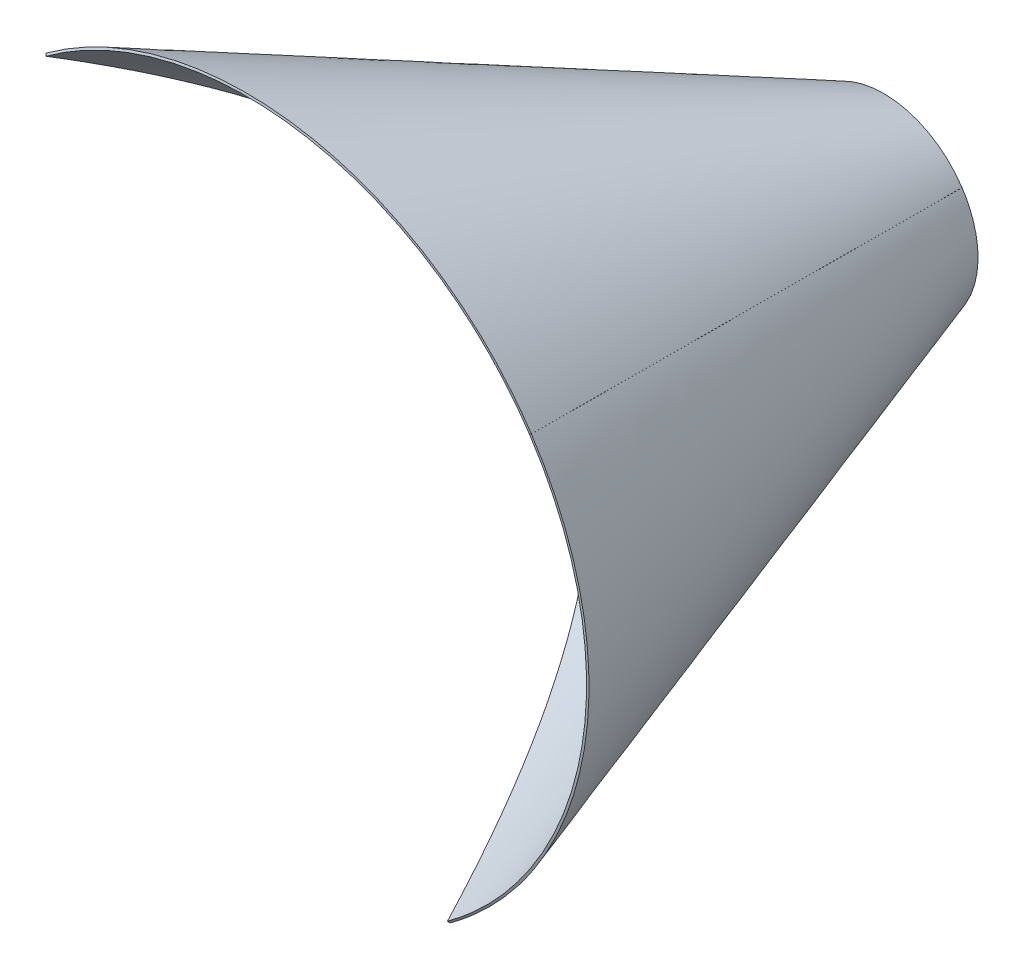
ISO-10303-21;
HEADER;
FILE_DESCRIPTION(('STEP AP214'),'2;1');
FILE_NAME('part.step','',(''),(''),'','','');
FILE_SCHEMA(('AUTOMOTIVE_DESIGN { 1 0 10303 214 1 1 1 1 }'));
ENDSEC;
DATA;
#1=APPLICATION_CONTEXT('core data for automotive mechanical design processes');
#2=APPLICATION_PROTOCOL_DEFINITION('international standard','automotive_design',2000,#1);
#3=PRODUCT_CONTEXT('',#1,'mechanical');
#4=PRODUCT('Part','Part','',(#3));
#5=PRODUCT_RELATED_PRODUCT_CATEGORY('part','',(#4));
#6=PRODUCT_DEFINITION_FORMATION('','',#4);
#7=PRODUCT_DEFINITION_CONTEXT('part definition',#1,'design');
#8=PRODUCT_DEFINITION('design','',#6,#7);
#9=PRODUCT_DEFINITION_SHAPE('','',#8);
#10=(LENGTH_UNIT() NAMED_UNIT(*) SI_UNIT(.MILLI.,.METRE.));
#11=(NAMED_UNIT(*) PLANE_ANGLE_UNIT() SI_UNIT($,.RADIAN.));
#12=(NAMED_UNIT(*) SI_UNIT($,.STERADIAN.) SOLID_ANGLE_UNIT());
#13=UNCERTAINTY_MEASURE_WITH_UNIT(LENGTH_MEASURE(1.E-05),#10,'distance_accuracy_value','');
#14=(GEOMETRIC_REPRESENTATION_CONTEXT(3) GLOBAL_UNCERTAINTY_ASSIGNED_CONTEXT((#13)) GLOBAL_UNIT_ASSIGNED_CONTEXT((#10,
#11,#12)) REPRESENTATION_CONTEXT('',''));
#15=CARTESIAN_POINT('',(0.,0.,0.));
#16=DIRECTION('',(0.,0.,1.));
#17=DIRECTION('',(1.,0.,0.));
#18=AXIS2_PLACEMENT_3D('',#15,#16,#17);
#19=CARTESIAN_POINT('',(502.61373396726,334.954836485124,0.0676910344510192));
#20=CARTESIAN_POINT('',(547.028700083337,268.308324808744,0.0676379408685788));
#21=CARTESIAN_POINT('',(577.300501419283,194.20072860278,0.00414121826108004));
#22=CARTESIAN_POINT('',(607.764798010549,40.0426292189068,-0.234862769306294));
#23=CARTESIAN_POINT('',(607.95568289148,-40.0113559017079,-0.411843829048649));
#24=CARTESIAN_POINT('',(576.453722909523,-197.05016592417,-0.845483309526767));
#25=CARTESIAN_POINT('',(545.401982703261,-270.824676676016,-1.09331993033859));
#26=CARTESIAN_POINT('',(457.836348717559,-401.233536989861,-1.57707627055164));
#27=CARTESIAN_POINT('',(401.324152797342,-457.867890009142,-1.81245350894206));
#28=CARTESIAN_POINT('',(268.022420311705,-546.423942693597,-2.22233740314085));
#29=CARTESIAN_POINT('',(193.957241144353,-576.540000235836,-2.39053921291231));
#30=CARTESIAN_POINT('',(39.9878552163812,-606.757175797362,-2.6599043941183));
#31=CARTESIAN_POINT('',(-39.9194992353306,-606.859251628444,-2.7625117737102));
#32=CARTESIAN_POINT('',(-196.647449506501,-575.335123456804,-2.91952278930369));
#33=CARTESIAN_POINT('',(-270.268461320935,-544.352374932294,-2.97179009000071));
#34=CARTESIAN_POINT('',(-400.488236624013,-457.033307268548,-3.0404528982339));
#35=CARTESIAN_POINT('',(-457.088356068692,-400.695659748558,-3.05689411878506));
#36=CARTESIAN_POINT('',(-545.720772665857,-267.723057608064,-3.0568799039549));
#37=CARTESIAN_POINT('',(-575.943176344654,-193.803432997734,-3.04042464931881));
#38=CARTESIAN_POINT('',(-606.43526727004,-40.0112162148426,-2.97173030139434));
#39=CARTESIAN_POINT('',(-606.705659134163,39.8631387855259,-2.91944536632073));
#40=CARTESIAN_POINT('',(-575.49876742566,196.654590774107,-2.76239154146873));
#41=CARTESIAN_POINT('',(-544.658666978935,270.370848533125,-2.65975932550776));
#42=CARTESIAN_POINT('',(-457.525141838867,400.859965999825,-2.39033894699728));
#43=CARTESIAN_POINT('',(-401.229621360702,457.635362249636,-2.22210619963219));
#44=CARTESIAN_POINT('',(-268.200807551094,546.600938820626,-1.81216874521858));
#45=CARTESIAN_POINT('',(-194.182395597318,576.971256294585,-1.57677060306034));
#46=CARTESIAN_POINT('',(-40.1207500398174,607.618106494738,-1.09300542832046));
#47=CARTESIAN_POINT('',(39.9218323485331,607.893072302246,-0.845181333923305));
#48=CARTESIAN_POINT('',(196.99165348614,576.546042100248,-0.411599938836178));
#49=CARTESIAN_POINT('',(270.809055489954,545.567530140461,-0.234661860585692));
#50=CARTESIAN_POINT('',(401.377226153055,458.133291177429,0.00424675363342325));
#51=CARTESIAN_POINT('',(458.13182853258,401.67770975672,0.0676911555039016));
#52=CARTESIAN_POINT('',(502.557901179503,335.038600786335,0.0676911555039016));
#53=CARTESIAN_POINT('',(499.285639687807,332.736908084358,0.));
#54=CARTESIAN_POINT('',(543.406847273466,266.531191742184,0.));
#55=CARTESIAN_POINT('',(573.475487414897,192.914715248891,0.));
#56=CARTESIAN_POINT('',(603.744923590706,39.7779997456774,0.));
#57=CARTESIAN_POINT('',(603.945719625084,-39.7422392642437,0.));
#58=CARTESIAN_POINT('',(572.716758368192,-195.768722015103,0.));
#59=CARTESIAN_POINT('',(541.925315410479,-269.085812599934,0.));
#60=CARTESIAN_POINT('',(455.047730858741,-398.775356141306,0.));
#61=CARTESIAN_POINT('',(398.961589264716,-455.147809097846,0.));
#62=CARTESIAN_POINT('',(266.553833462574,-543.395741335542,0.));
#63=CARTESIAN_POINT('',(192.938609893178,-573.46744880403,0.));
#64=CARTESIAN_POINT('',(39.8031557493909,-603.743265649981,0.));
#65=CARTESIAN_POINT('',(-39.7170748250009,-603.947375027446,0.));
#66=CARTESIAN_POINT('',(-195.744858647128,-572.724914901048,0.));
#67=CARTESIAN_POINT('',(-269.063232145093,-541.936526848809,0.));
#68=CARTESIAN_POINT('',(-398.756395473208,-455.064346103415,0.));
#69=CARTESIAN_POINT('',(-455.131185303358,-398.98055341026,0.));
#70=CARTESIAN_POINT('',(-543.384634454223,-266.576474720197,0.));
#71=CARTESIAN_POINT('',(-573.45940919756,-192.962504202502,0.));
#72=CARTESIAN_POINT('',(-603.741606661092,-39.8283116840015,0.));
#73=CARTESIAN_POINT('',(-603.949029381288,39.6919103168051,0.));
#74=CARTESIAN_POINT('',(-572.733070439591,195.720994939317,0.));
#75=CARTESIAN_POINT('',(-541.947737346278,269.040651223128,0.));
#76=CARTESIAN_POINT('',(-455.080960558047,398.737434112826,0.));
#77=CARTESIAN_POINT('',(-398.999516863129,455.114560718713,0.));
#78=CARTESIAN_POINT('',(-266.599115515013,543.373526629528,0.));
#79=CARTESIAN_POINT('',(-192.986398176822,573.4513685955,0.));
#80=CARTESIAN_POINT('',(-39.8534675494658,603.73994662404,0.));
#81=CARTESIAN_POINT('',(39.6667457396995,603.950682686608,0.));
#82=CARTESIAN_POINT('',(195.697130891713,572.741224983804,0.));
#83=CARTESIAN_POINT('',(269.018069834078,541.958946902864,0.));
#84=CARTESIAN_POINT('',(398.71847206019,455.097574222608,0.));
#85=CARTESIAN_POINT('',(455.097935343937,399.018479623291,0.));
#86=CARTESIAN_POINT('',(499.230176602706,332.820117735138,0.));
#87=B_SPLINE_SURFACE_WITH_KNOTS('',1,3,((#19,#20,#21,#22,#23,#24,#25,#26,#27,#28,#29,#30,#31,
#32,#33,#34,#35,#36,#37,#38,#39,#40,#41,#42,#43,#44,#45,#46,#47,#48,#49,#50,#51,#52),(#53,#54,
#55,#56,#57,#58,#59,#60,#61,#62,#63,#64,#65,#66,#67,#68,#69,#70,#71,#72,#73,#74,#75,#76,#77,#78,
#79,#80,#81,#82,#83,#84,#85,#86)),.UNSPECIFIED.,.F.,.F.,.F.,(2,2),(4,2,2,2,2,2,2,2,2,2,2,2,2,2,
2,2,4),(0.,1.),(0.,0.0625,0.125,0.1875,0.25,0.3125,0.375,0.4375,0.5,0.5625,0.625,0.6875,0.75,
0.8125,0.875,0.9375,1.),.UNSPECIFIED.);
#88=CARTESIAN_POINT('',(499.285639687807,332.736908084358,0.));
#89=CARTESIAN_POINT('',(543.406847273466,266.531191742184,0.));
#90=CARTESIAN_POINT('',(573.475487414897,192.914715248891,0.));
#91=CARTESIAN_POINT('',(603.744923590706,39.7779997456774,0.));
#92=CARTESIAN_POINT('',(603.945719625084,-39.7422392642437,0.));
#93=CARTESIAN_POINT('',(572.716758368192,-195.768722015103,0.));
#94=CARTESIAN_POINT('',(541.925315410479,-269.085812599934,0.));
#95=CARTESIAN_POINT('',(455.047730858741,-398.775356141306,0.));
#96=CARTESIAN_POINT('',(398.961589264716,-455.147809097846,0.));
#97=CARTESIAN_POINT('',(266.553833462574,-543.395741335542,0.));
#98=CARTESIAN_POINT('',(192.938609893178,-573.46744880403,0.));
#99=CARTESIAN_POINT('',(39.8031557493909,-603.743265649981,0.));
#100=CARTESIAN_POINT('',(-39.7170748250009,-603.947375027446,0.));
#101=CARTESIAN_POINT('',(-195.744858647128,-572.724914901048,0.));
#102=CARTESIAN_POINT('',(-269.063232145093,-541.936526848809,0.));
#103=CARTESIAN_POINT('',(-398.756395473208,-455.064346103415,0.));
#104=CARTESIAN_POINT('',(-455.131185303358,-398.98055341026,0.));
#105=CARTESIAN_POINT('',(-543.384634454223,-266.576474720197,0.));
#106=CARTESIAN_POINT('',(-573.45940919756,-192.962504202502,0.));
#107=CARTESIAN_POINT('',(-603.741606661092,-39.8283116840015,0.));
#108=CARTESIAN_POINT('',(-603.949029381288,39.6919103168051,0.));
#109=CARTESIAN_POINT('',(-572.733070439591,195.720994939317,0.));
#110=CARTESIAN_POINT('',(-541.947737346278,269.040651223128,0.));
#111=CARTESIAN_POINT('',(-455.080960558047,398.737434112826,0.));
#112=CARTESIAN_POINT('',(-398.999516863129,455.114560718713,0.));
#113=CARTESIAN_POINT('',(-266.599115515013,543.373526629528,0.));
#114=CARTESIAN_POINT('',(-192.986398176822,573.4513685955,0.));
#115=CARTESIAN_POINT('',(-39.8534675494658,603.73994662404,0.));
#116=CARTESIAN_POINT('',(39.6667457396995,603.950682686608,0.));
#117=CARTESIAN_POINT('',(195.697130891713,572.741224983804,0.));
#118=CARTESIAN_POINT('',(269.018069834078,541.958946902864,0.));
#119=CARTESIAN_POINT('',(398.71847206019,455.097574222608,0.));
#120=CARTESIAN_POINT('',(455.097935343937,399.018479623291,0.));
#121=CARTESIAN_POINT('',(499.230176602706,332.820117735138,0.));
#122=B_SPLINE_CURVE_WITH_KNOTS('',3,(#88,#89,#90,#91,#92,#93,#94,#95,#96,#97,#98,#99,#100,#101,
#102,#103,#104,#105,#106,#107,#108,#109,#110,#111,#112,#113,#114,#115,#116,#117,#118,#119,#120,
#121),.UNSPECIFIED.,.F.,.F.,(4,2,2,2,2,2,2,2,2,2,2,2,2,2,2,2,4),(0.,0.0625,0.125,0.1875,0.25,
0.3125,0.375,0.4375,0.5,0.5625,0.625,0.6875,0.75,0.8125,0.875,0.9375,1.),.UNSPECIFIED.);
#123=CARTESIAN_POINT('',(499.285639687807,332.736908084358,0.));
#124=VERTEX_POINT('',#123);
#125=CARTESIAN_POINT('',(354.402157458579,-484.148488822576,0.));
#126=VERTEX_POINT('',#125);
#127=EDGE_CURVE('E182',#124,#126,#122,.T.);
#128=CARTESIAN_POINT('',(354.402157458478,-484.148488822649,5.62192061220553E-12));
#129=CARTESIAN_POINT('',(354.581817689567,-484.381285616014,-0.163932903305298));
#130=CARTESIAN_POINT('',(354.761479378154,-484.614084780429,-0.32786084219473));
#131=CARTESIAN_POINT('',(355.120805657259,-485.079687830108,-0.655706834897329));
#132=CARTESIAN_POINT('',(355.300470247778,-485.312491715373,-0.819624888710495));
#133=CARTESIAN_POINT('',(355.832504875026,-486.001887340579,-1.30501135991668));
#134=CARTESIAN_POINT('',(356.184879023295,-486.458485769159,-1.62646577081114));
#135=CARTESIAN_POINT('',(356.53725867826,-486.915093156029,-1.9479014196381));
#136=B_SPLINE_CURVE_WITH_KNOTS('',3,(#128,#129,#130,#131,#132,#133,#134,#135),.UNSPECIFIED.,.F.,
.F.,(4,2,2,4),(0.,1.01000756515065,2.02001513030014,4.00088449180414),.UNSPECIFIED.);
#137=CARTESIAN_POINT('',(356.537285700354,-486.915126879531,-1.9479220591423));
#138=VERTEX_POINT('',#137);
#139=EDGE_CURVE('E115',#126,#138,#136,.T.);
#140=CARTESIAN_POINT('',(502.61373396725,334.954836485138,0.0676910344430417));
#141=CARTESIAN_POINT('',(507.998694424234,326.874917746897,0.0676858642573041));
#142=CARTESIAN_POINT('',(513.188682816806,318.665066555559,0.0667480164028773));
#143=CARTESIAN_POINT('',(523.145985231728,302.040122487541,0.0630187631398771));
#144=CARTESIAN_POINT('',(527.914995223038,293.626045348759,0.0602352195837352));
#145=CARTESIAN_POINT('',(537.027142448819,276.608874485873,0.0528394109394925));
#146=CARTESIAN_POINT('',(541.371734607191,268.006559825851,0.0482336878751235));
#147=CARTESIAN_POINT('',(549.63214844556,250.629290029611,0.0372210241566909));
#148=CARTESIAN_POINT('',(553.549185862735,241.85491277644,0.0308193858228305));
#149=CARTESIAN_POINT('',(560.951505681,224.149798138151,0.0162422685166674));
#150=CARTESIAN_POINT('',(564.437768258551,215.219470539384,0.00807093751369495));
#151=CARTESIAN_POINT('',(570.975567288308,197.218712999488,-0.0100177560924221));
#152=CARTESIAN_POINT('',(574.027851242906,188.148554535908,-0.0199320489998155));
#153=CARTESIAN_POINT('',(579.694707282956,169.884358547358,-0.0414783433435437));
#154=CARTESIAN_POINT('',(582.309796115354,160.690481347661,-0.0531082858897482));
#155=CARTESIAN_POINT('',(587.099269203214,142.195047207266,-0.0780564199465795));
#156=CARTESIAN_POINT('',(589.273939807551,132.893564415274,-0.0913735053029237));
#157=CARTESIAN_POINT('',(593.179576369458,114.19909855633,-0.119664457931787));
#158=CARTESIAN_POINT('',(594.910596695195,104.806126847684,-0.134638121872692));
#159=CARTESIAN_POINT('',(597.925928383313,85.9448479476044,-0.166207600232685));
#160=CARTESIAN_POINT('',(599.210058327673,76.4765117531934,-0.182804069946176));
#161=CARTESIAN_POINT('',(601.32860426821,57.4806580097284,-0.217579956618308));
#162=CARTESIAN_POINT('',(602.162596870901,47.9530932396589,-0.235760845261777));
#163=CARTESIAN_POINT('',(603.377866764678,28.8549291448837,-0.27366022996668));
#164=CARTESIAN_POINT('',(603.758470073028,19.2842869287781,-0.293380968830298));
#165=CARTESIAN_POINT('',(604.063970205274,0.116109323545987,-0.334306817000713));
#166=CARTESIAN_POINT('',(603.987931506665,-9.48144098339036,-0.355514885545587));
#167=CARTESIAN_POINT('',(603.377168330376,-28.687296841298,-0.399352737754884));
#168=CARTESIAN_POINT('',(602.841233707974,-38.295563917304,-0.421986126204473));
#169=CARTESIAN_POINT('',(601.307734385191,-57.5067230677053,-0.468600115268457));
#170=CARTESIAN_POINT('',(600.30867011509,-67.1094954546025,-0.492584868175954));
#171=CARTESIAN_POINT('',(597.845947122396,-86.2935305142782,-0.541816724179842));
#172=CARTESIAN_POINT('',(596.380483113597,-95.8745614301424,-0.567068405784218));
#173=CARTESIAN_POINT('',(592.984698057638,-114.985059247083,-0.618689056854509));
#174=CARTESIAN_POINT('',(591.052925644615,-124.514268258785,-0.645061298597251));
#175=CARTESIAN_POINT('',(586.73900848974,-143.434679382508,-0.698701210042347));
#176=CARTESIAN_POINT('',(584.358483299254,-152.8262507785,-0.725965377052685));
#177=CARTESIAN_POINT('',(579.157767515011,-171.447497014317,-0.78120942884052));
#178=CARTESIAN_POINT('',(576.339322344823,-180.677659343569,-0.809186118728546));
#179=CARTESIAN_POINT('',(570.272333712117,-198.962342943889,-0.86571728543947));
#180=CARTESIAN_POINT('',(567.025212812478,-208.01733625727,-0.894269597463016));
#181=CARTESIAN_POINT('',(560.110384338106,-225.937969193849,-0.951812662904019));
#182=CARTESIAN_POINT('',(556.44380323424,-234.804043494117,-0.980802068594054));
#183=CARTESIAN_POINT('',(548.699566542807,-252.333165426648,-1.03908443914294));
#184=CARTESIAN_POINT('',(544.622765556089,-260.996590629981,-1.06837666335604));
#185=CARTESIAN_POINT('',(536.067587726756,-278.106776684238,-1.12713375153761));
#186=CARTESIAN_POINT('',(531.589815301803,-286.553839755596,-1.15659829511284));
#187=CARTESIAN_POINT('',(522.24218463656,-303.217698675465,-1.21557406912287));
#188=CARTESIAN_POINT('',(517.372699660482,-311.434703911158,-1.24508522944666));
#189=CARTESIAN_POINT('',(507.251125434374,-327.624878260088,-1.30403368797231));
#190=CARTESIAN_POINT('',(501.99919474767,-335.598146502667,-1.33347101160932));
#191=CARTESIAN_POINT('',(491.122203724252,-351.28731209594,-1.39215711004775));
#192=CARTESIAN_POINT('',(485.49710131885,-359.003180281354,-1.42140586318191));
#193=CARTESIAN_POINT('',(473.883235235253,-374.164045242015,-1.47960634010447));
#194=CARTESIAN_POINT('',(467.894240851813,-381.608865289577,-1.50855786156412));
#195=CARTESIAN_POINT('',(455.562055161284,-396.214170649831,-1.56606193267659));
#196=CARTESIAN_POINT('',(449.218454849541,-403.374310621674,-1.59461397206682));
#197=CARTESIAN_POINT('',(436.186513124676,-417.396824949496,-1.65122389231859));
#198=CARTESIAN_POINT('',(429.497593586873,-424.25866203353,-1.6792808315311));
#199=CARTESIAN_POINT('',(415.784479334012,-437.671198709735,-1.73481265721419));
#200=CARTESIAN_POINT('',(408.759546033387,-444.221143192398,-1.76228604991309));
#201=CARTESIAN_POINT('',(394.383809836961,-456.99649334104,-1.81656950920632));
#202=CARTESIAN_POINT('',(387.032116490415,-463.220897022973,-1.84337740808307));
#203=CARTESIAN_POINT('',(372.012465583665,-475.332078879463,-1.89625909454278));
#204=CARTESIAN_POINT('',(364.343475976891,-481.217577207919,-1.9223299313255));
#205=CARTESIAN_POINT('',(356.537311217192,-486.915161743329,-1.94794271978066));
#206=B_SPLINE_CURVE_WITH_KNOTS('',3,(#140,#141,#142,#143,#144,#145,#146,#147,#148,#149,#150,
#151,#152,#153,#154,#155,#156,#157,#158,#159,#160,#161,#162,#163,#164,#165,#166,#167,#168,#169,
#170,#171,#172,#173,#174,#175,#176,#177,#178,#179,#180,#181,#182,#183,#184,#185,#186,#187,#188,
#189,#190,#191,#192,#193,#194,#195,#196,#197,#198,#199,#200,#201,#202,#203,#204,#205),
.UNSPECIFIED.,.F.,.F.,(4,2,2,2,2,2,2,2,2,2,2,2,2,2,2,2,2,2,2,2,2,2,2,2,2,2,2,2,2,2,2,2,4),(0.,
29.1269813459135,58.1306847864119,87.0311899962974,115.847250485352,144.596486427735,
173.295587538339,201.960523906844,230.606762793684,259.249489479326,287.903830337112,
316.585076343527,345.308905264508,374.091600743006,402.950266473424,431.903033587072,
460.969259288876,490.127146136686,519.181749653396,548.123387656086,576.971289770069,
605.74346243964,634.456889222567,663.127739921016,691.771586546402,720.403624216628,
749.038895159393,777.69251404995,806.37989292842,835.116963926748,863.920397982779,
892.807817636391,921.798001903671),.UNSPECIFIED.);
#207=CARTESIAN_POINT('',(502.61373396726,334.954836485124,0.0676910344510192));
#208=VERTEX_POINT('',#207);
#209=EDGE_CURVE('E357',#208,#138,#206,.T.);
#210=CARTESIAN_POINT('',(499.285639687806,332.736908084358,0.));
#211=CARTESIAN_POINT('',(502.61373396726,334.954836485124,0.0676910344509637));
#212=B_SPLINE_CURVE_WITH_KNOTS('',1,(#210,#211),.UNSPECIFIED.,.F.,.F.,(2,2),(0.,1.),.UNSPECIFIED.);
#213=EDGE_CURVE('E150',#124,#208,#212,.T.);
#214=ORIENTED_EDGE('',*,*,#127,.T.);
#215=ORIENTED_EDGE('',*,*,#139,.T.);
#216=ORIENTED_EDGE('',*,*,#209,.F.);
#217=ORIENTED_EDGE('',*,*,#213,.F.);
#218=EDGE_LOOP('',(#214,#215,#216,#217));
#219=FACE_BOUND('',#218,.T.);
#220=ADVANCED_FACE('F97',(#219),#87,.T.);
#221=CARTESIAN_POINT('',(-356.479462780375,486.859030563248,-2.08408020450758));
#222=CARTESIAN_POINT('',(-348.210430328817,492.93246794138,-2.05870903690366));
#223=CARTESIAN_POINT('',(-339.786437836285,498.794927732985,-2.03279511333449));
#224=CARTESIAN_POINT('',(-322.660565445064,510.076692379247,-1.97994916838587));
#225=CARTESIAN_POINT('',(-313.959014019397,515.496495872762,-1.95301834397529));
#226=CARTESIAN_POINT('',(-296.328637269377,525.863596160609,-1.89826456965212));
#227=CARTESIAN_POINT('',(-287.400936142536,530.812804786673,-1.87044590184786));
#228=CARTESIAN_POINT('',(-269.337591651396,540.235069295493,-1.81400952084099));
#229=CARTESIAN_POINT('',(-260.202788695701,544.709736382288,-1.78539495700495));
#230=CARTESIAN_POINT('',(-241.744512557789,553.179242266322,-1.72745537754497));
#231=CARTESIAN_POINT('',(-232.421642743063,557.175396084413,-1.69813258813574));
#232=CARTESIAN_POINT('',(-213.606483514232,564.684214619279,-1.63887799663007));
#233=CARTESIAN_POINT('',(-204.114602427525,568.197902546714,-1.60894764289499));
#234=CARTESIAN_POINT('',(-184.980645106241,574.738133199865,-1.54858710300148));
#235=CARTESIAN_POINT('',(-175.338820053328,577.76541080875,-1.51815774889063));
#236=CARTESIAN_POINT('',(-155.924179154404,583.329175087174,-1.45691700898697));
#237=CARTESIAN_POINT('',(-146.151491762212,585.866110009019,-1.42610599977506));
#238=CARTESIAN_POINT('',(-126.494312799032,590.445556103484,-1.36422765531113));
#239=CARTESIAN_POINT('',(-116.609858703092,592.488228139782,-1.33316040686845));
#240=CARTESIAN_POINT('',(-96.748317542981,596.075532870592,-1.27090287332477));
#241=CARTESIAN_POINT('',(-86.7712069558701,597.620035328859,-1.23971255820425));
#242=CARTESIAN_POINT('',(-66.7435097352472,600.207407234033,-1.17734927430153));
#243=CARTESIAN_POINT('',(-56.692867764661,601.249848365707,-1.14617634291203));
#244=CARTESIAN_POINT('',(-36.5372505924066,602.829530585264,-1.08399473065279));
#245=CARTESIAN_POINT('',(-26.4322176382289,603.366034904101,-1.05298635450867));
#246=CARTESIAN_POINT('',(-6.18694576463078,603.930309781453,-0.991286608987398));
#247=CARTESIAN_POINT('',(3.95332268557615,603.957021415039,-0.960596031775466));
#248=CARTESIAN_POINT('',(24.2499550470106,603.49821056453,-0.899689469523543));
#249=CARTESIAN_POINT('',(34.4062873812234,603.01129022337,-0.869475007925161));
#250=CARTESIAN_POINT('',(54.7159619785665,601.521773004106,-0.809682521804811));
#251=CARTESIAN_POINT('',(64.8691754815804,600.517420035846,-0.780107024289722));
#252=CARTESIAN_POINT('',(85.1535401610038,597.98958402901,-0.72175529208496));
#253=CARTESIAN_POINT('',(95.2844251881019,596.463965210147,-0.692982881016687));
#254=CARTESIAN_POINT('',(115.488004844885,592.893440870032,-0.636454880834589));
#255=CARTESIAN_POINT('',(125.560406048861,590.846874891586,-0.608702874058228));
#256=CARTESIAN_POINT('',(145.549766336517,586.250902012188,-0.554483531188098));
#257=CARTESIAN_POINT('',(155.467168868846,583.703423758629,-0.528011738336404));
#258=CARTESIAN_POINT('',(175.120194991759,578.118062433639,-0.476512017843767));
#259=CARTESIAN_POINT('',(184.856385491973,575.082174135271,-0.451478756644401));
#260=CARTESIAN_POINT('',(204.130788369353,568.531340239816,-0.402949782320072));
#261=CARTESIAN_POINT('',(213.669543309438,565.017990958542,-0.379449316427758));
#262=CARTESIAN_POINT('',(232.53292867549,557.523497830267,-0.334069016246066));
#263=CARTESIAN_POINT('',(241.858048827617,553.543586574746,-0.312185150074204));
#264=CARTESIAN_POINT('',(260.278075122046,545.127209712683,-0.270106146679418));
#265=CARTESIAN_POINT('',(269.373392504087,540.691644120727,-0.249907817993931));
#266=CARTESIAN_POINT('',(287.317770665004,531.375158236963,-0.211257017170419));
#267=CARTESIAN_POINT('',(296.16714036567,526.494832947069,-0.192802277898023));
#268=CARTESIAN_POINT('',(313.603621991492,516.299992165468,-0.157686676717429));
#269=CARTESIAN_POINT('',(322.190917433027,510.98579054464,-0.141024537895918));
#270=CARTESIAN_POINT('',(339.087285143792,499.93432726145,-0.109535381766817));
#271=CARTESIAN_POINT('',(347.396392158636,494.197118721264,-0.0947081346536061));
#272=CARTESIAN_POINT('',(363.720449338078,482.310740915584,-0.0669251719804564));
#273=CARTESIAN_POINT('',(371.735260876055,476.161381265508,-0.0539703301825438));
#274=CARTESIAN_POINT('',(387.454821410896,463.461772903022,-0.0299654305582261));
#275=CARTESIAN_POINT('',(395.159231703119,456.911104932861,-0.0189174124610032));
#276=CARTESIAN_POINT('',(410.242112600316,443.419929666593,0.00124248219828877));
#277=CARTESIAN_POINT('',(417.620014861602,436.47878695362,0.010351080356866));
#278=CARTESIAN_POINT('',(432.034021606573,422.217688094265,0.0266017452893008));
#279=CARTESIAN_POINT('',(439.06929505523,414.896891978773,0.0337392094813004));
#280=CARTESIAN_POINT('',(452.782239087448,399.887515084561,0.0460179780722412));
#281=CARTESIAN_POINT('',(459.458779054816,392.197901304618,0.051153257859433));
#282=CARTESIAN_POINT('',(472.438380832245,376.461839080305,0.0593980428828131));
#283=CARTESIAN_POINT('',(478.739970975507,368.414176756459,0.0624999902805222));
#284=CARTESIAN_POINT('',(490.954198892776,351.97321118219,0.0666519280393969));
#285=CARTESIAN_POINT('',(496.864980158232,343.578528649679,0.0676927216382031));
#286=CARTESIAN_POINT('',(502.557901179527,335.038600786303,0.0676911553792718));
#287=B_SPLINE_CURVE_WITH_KNOTS('',3,(#221,#222,#223,#224,#225,#226,#227,#228,#229,#230,#231,
#232,#233,#234,#235,#236,#237,#238,#239,#240,#241,#242,#243,#244,#245,#246,#247,#248,#249,#250,
#251,#252,#253,#254,#255,#256,#257,#258,#259,#260,#261,#262,#263,#264,#265,#266,#267,#268,#269,
#270,#271,#272,#273,#274,#275,#276,#277,#278,#279,#280,#281,#282,#283,#284,#285,#286),
.UNSPECIFIED.,.F.,.F.,(4,2,2,2,2,2,2,2,2,2,2,2,2,2,2,2,2,2,2,2,2,2,2,2,2,2,2,2,2,2,2,2,4),(0.,
30.7761820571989,61.5172032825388,92.1274617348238,122.630216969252,153.047122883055,
183.39849015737,213.703561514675,243.980796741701,274.24816459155,304.523438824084,
334.824495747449,365.169610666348,395.577750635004,426.068860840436,456.66414183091,
487.386314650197,518.207664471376,548.912588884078,579.495150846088,609.977871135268,
640.381802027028,670.726793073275,701.031768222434,731.315011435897,761.594458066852,
791.887989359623,822.213727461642,852.590328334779,883.037269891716,913.575132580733,
944.225869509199,975.013063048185),.UNSPECIFIED.);
#288=CARTESIAN_POINT('',(-356.47947962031,486.859053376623,-2.08405345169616));
#289=VERTEX_POINT('',#288);
#290=CARTESIAN_POINT('',(502.557901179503,335.038600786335,0.0676911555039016));
#291=VERTEX_POINT('',#290);
#292=EDGE_CURVE('E172',#289,#291,#287,.T.);
#293=CARTESIAN_POINT('',(-356.479498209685,486.859074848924,-2.08402674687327));
#294=CARTESIAN_POINT('',(-356.316173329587,486.622584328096,-1.90868890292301));
#295=CARTESIAN_POINT('',(-356.152850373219,486.386096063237,-1.73334622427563));
#296=CARTESIAN_POINT('',(-355.826208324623,485.913124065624,-1.38265115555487));
#297=CARTESIAN_POINT('',(-355.662889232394,485.67664033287,-1.20729876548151));
#298=CARTESIAN_POINT('',(-355.179226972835,484.97630265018,-0.687979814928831));
#299=CARTESIAN_POINT('',(-354.85888933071,484.512455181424,-0.343999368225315));
#300=CARTESIAN_POINT('',(-354.538559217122,484.048616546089,3.1300933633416E-11));
#301=B_SPLINE_CURVE_WITH_KNOTS('',3,(#293,#294,#295,#296,#297,#298,#299,#300),.UNSPECIFIED.,.F.,
.F.,(4,2,2,4),(0.,1.01000756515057,2.02001513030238,4.00113578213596),.UNSPECIFIED.);
#302=CARTESIAN_POINT('',(-354.538559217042,484.048616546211,0.));
#303=VERTEX_POINT('',#302);
#304=EDGE_CURVE('E162',#289,#303,#301,.T.);
#305=CARTESIAN_POINT('',(499.285639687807,332.736908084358,0.));
#306=CARTESIAN_POINT('',(543.406847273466,266.531191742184,0.));
#307=CARTESIAN_POINT('',(573.475487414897,192.914715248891,0.));
#308=CARTESIAN_POINT('',(603.744923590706,39.7779997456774,0.));
#309=CARTESIAN_POINT('',(603.945719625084,-39.7422392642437,0.));
#310=CARTESIAN_POINT('',(572.716758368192,-195.768722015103,0.));
#311=CARTESIAN_POINT('',(541.925315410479,-269.085812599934,0.));
#312=CARTESIAN_POINT('',(455.047730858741,-398.775356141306,0.));
#313=CARTESIAN_POINT('',(398.961589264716,-455.147809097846,0.));
#314=CARTESIAN_POINT('',(266.553833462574,-543.395741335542,0.));
#315=CARTESIAN_POINT('',(192.938609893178,-573.46744880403,0.));
#316=CARTESIAN_POINT('',(39.8031557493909,-603.743265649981,0.));
#317=CARTESIAN_POINT('',(-39.7170748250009,-603.947375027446,0.));
#318=CARTESIAN_POINT('',(-195.744858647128,-572.724914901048,0.));
#319=CARTESIAN_POINT('',(-269.063232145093,-541.936526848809,0.));
#320=CARTESIAN_POINT('',(-398.756395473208,-455.064346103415,0.));
#321=CARTESIAN_POINT('',(-455.131185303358,-398.98055341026,0.));
#322=CARTESIAN_POINT('',(-543.384634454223,-266.576474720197,0.));
#323=CARTESIAN_POINT('',(-573.45940919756,-192.962504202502,0.));
#324=CARTESIAN_POINT('',(-603.741606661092,-39.8283116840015,0.));
#325=CARTESIAN_POINT('',(-603.949029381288,39.6919103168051,0.));
#326=CARTESIAN_POINT('',(-572.733070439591,195.720994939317,0.));
#327=CARTESIAN_POINT('',(-541.947737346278,269.040651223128,0.));
#328=CARTESIAN_POINT('',(-455.080960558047,398.737434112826,0.));
#329=CARTESIAN_POINT('',(-398.999516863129,455.114560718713,0.));
#330=CARTESIAN_POINT('',(-266.599115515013,543.373526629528,0.));
#331=CARTESIAN_POINT('',(-192.986398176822,573.4513685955,0.));
#332=CARTESIAN_POINT('',(-39.8534675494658,603.73994662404,0.));
#333=CARTESIAN_POINT('',(39.6667457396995,603.950682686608,0.));
#334=CARTESIAN_POINT('',(195.697130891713,572.741224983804,0.));
#335=CARTESIAN_POINT('',(269.018069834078,541.958946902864,0.));
#336=CARTESIAN_POINT('',(398.71847206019,455.097574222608,0.));
#337=CARTESIAN_POINT('',(455.097935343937,399.018479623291,0.));
#338=CARTESIAN_POINT('',(499.230176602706,332.820117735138,0.));
#339=B_SPLINE_CURVE_WITH_KNOTS('',3,(#305,#306,#307,#308,#309,#310,#311,#312,#313,#314,#315,
#316,#317,#318,#319,#320,#321,#322,#323,#324,#325,#326,#327,#328,#329,#330,#331,#332,#333,#334,
#335,#336,#337,#338),.UNSPECIFIED.,.F.,.F.,(4,2,2,2,2,2,2,2,2,2,2,2,2,2,2,2,4),(0.,0.0625,0.125,
0.1875,0.25,0.3125,0.375,0.4375,0.5,0.5625,0.625,0.6875,0.75,0.8125,0.875,0.9375,1.),.UNSPECIFIED.);
#340=CARTESIAN_POINT('',(499.230176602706,332.820117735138,0.));
#341=VERTEX_POINT('',#340);
#342=EDGE_CURVE('E169',#303,#341,#339,.T.);
#343=CARTESIAN_POINT('',(499.230176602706,332.820117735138,0.));
#344=CARTESIAN_POINT('',(502.557901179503,335.038600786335,0.0676911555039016));
#345=B_SPLINE_CURVE_WITH_KNOTS('',1,(#343,#344),.UNSPECIFIED.,.F.,.F.,(2,2),(0.,1.),.UNSPECIFIED.);
#346=EDGE_CURVE('E376',#341,#291,#345,.T.);
#347=ORIENTED_EDGE('',*,*,#292,.F.);
#348=ORIENTED_EDGE('',*,*,#304,.T.);
#349=ORIENTED_EDGE('',*,*,#342,.T.);
#350=ORIENTED_EDGE('',*,*,#346,.T.);
#351=EDGE_LOOP('',(#347,#348,#349,#350));
#352=FACE_BOUND('',#351,.T.);
#353=ADVANCED_FACE('F167',(#352),#87,.T.);
#354=CARTESIAN_POINT('',(499.285639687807,332.736908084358,0.));
#355=CARTESIAN_POINT('',(509.847592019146,339.77820964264,-750.));
#356=CARTESIAN_POINT('',(587.528054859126,200.325475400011,0.));
#357=CARTESIAN_POINT('',(533.655179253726,304.019022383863,-750.));
#358=CARTESIAN_POINT('',(619.56020025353,38.2710021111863,0.));
#359=CARTESIAN_POINT('',(542.284693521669,260.264112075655,-750.));
#360=CARTESIAN_POINT('',(557.102277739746,-273.781963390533,0.));
#361=CARTESIAN_POINT('',(525.389078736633,176.022667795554,-750.));
#362=CARTESIAN_POINT('',(465.165467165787,-411.023842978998,0.));
#363=CARTESIAN_POINT('',(500.554531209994,138.979369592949,-750.));
#364=CARTESIAN_POINT('',(200.349955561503,-587.51970745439,0.));
#365=CARTESIAN_POINT('',(429.043505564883,91.3531589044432,-750.));
#366=CARTESIAN_POINT('',(38.2968170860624,-619.558605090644,0.));
#367=CARTESIAN_POINT('',(385.289927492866,82.7168924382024,-750.));
#368=CARTESIAN_POINT('',(-273.758750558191,-557.11368483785,0.));
#369=CARTESIAN_POINT('',(301.045876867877,99.5995067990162,-750.));
#370=CARTESIAN_POINT('',(-411.004460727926,-465.182592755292,0.));
#371=CARTESIAN_POINT('',(263.998746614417,124.428337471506,-750.));
#372=CARTESIAN_POINT('',(-587.511359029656,-200.374435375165,0.));
#373=CARTESIAN_POINT('',(216.361500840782,195.932012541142,-750.));
#374=CARTESIAN_POINT('',(-619.557008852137,-38.3226319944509,0.));
#375=CARTESIAN_POINT('',(207.718482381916,239.684257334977,-750.));
#376=CARTESIAN_POINT('',(-557.125090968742,273.735537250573,0.));
#377=CARTESIAN_POINT('',(224.588095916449,323.930912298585,-750.));
#378=CARTESIAN_POINT('',(-465.199717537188,410.985077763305,0.));
#379=CARTESIAN_POINT('',(249.411209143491,360.981873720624,-750.));
#380=CARTESIAN_POINT('',(-200.398914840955,587.503009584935,0.));
#381=CARTESIAN_POINT('',(320.907531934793,408.630153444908,-750.));
#382=CARTESIAN_POINT('',(-38.3484468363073,619.555411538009,0.));
#383=CARTESIAN_POINT('',(364.658442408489,417.279923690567,-750.));
#384=CARTESIAN_POINT('',(273.71232346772,557.136496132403,0.));
#385=CARTESIAN_POINT('',(448.907699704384,400.423311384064,-750.));
#386=CARTESIAN_POINT('',(410.965694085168,465.216841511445,0.));
#387=CARTESIAN_POINT('',(485.962491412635,375.60591619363,-750.));
#388=CARTESIAN_POINT('',(499.230176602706,332.820117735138,0.));
#389=CARTESIAN_POINT('',(509.792147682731,339.861431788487,-750.));
#390=B_SPLINE_SURFACE_WITH_KNOTS('',3,1,((#354,#355),(#356,#357),(#358,#359),(#360,#361),(#362,
#363),(#364,#365),(#366,#367),(#368,#369),(#370,#371),(#372,#373),(#374,#375),(#376,#377),(#378,
#379),(#380,#381),(#382,#383),(#384,#385),(#386,#387),(#388,#389)),.UNSPECIFIED.,.F.,.F.,.F.,(4,
2,2,2,2,2,2,2,4),(2,2),(0.,0.125,0.25,0.375,0.5,0.625,0.75,0.875,1.),(0.,1.),.UNSPECIFIED.);
#391=OFFSET_SURFACE('',#390,4.,.F.);
#392=ORIENTED_EDGE('',*,*,#209,.T.);
#393=CARTESIAN_POINT('',(356.537311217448,-486.915161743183,-1.94794271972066));
#394=CARTESIAN_POINT('',(354.754131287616,-484.013228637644,-8.03656574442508));
#395=CARTESIAN_POINT('',(352.957753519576,-481.094190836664,-14.1131912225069));
#396=CARTESIAN_POINT('',(349.337079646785,-475.219815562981,-26.2425878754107));
#397=CARTESIAN_POINT('',(347.512776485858,-472.264468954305,-32.2953525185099));
#398=CARTESIAN_POINT('',(343.835308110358,-466.316331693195,-44.3751426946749));
#399=CARTESIAN_POINT('',(341.982137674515,-463.323534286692,-50.4021633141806));
#400=CARTESIAN_POINT('',(338.245891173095,-457.299223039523,-62.4284715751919));
#401=CARTESIAN_POINT('',(336.362811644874,-454.267704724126,-68.4277559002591));
#402=CARTESIAN_POINT('',(332.565609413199,-448.164557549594,-80.3965114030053));
#403=CARTESIAN_POINT('',(330.651484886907,-445.09292633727,-86.3659808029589));
#404=CARTESIAN_POINT('',(326.790973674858,-438.908054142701,-98.2729466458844));
#405=CARTESIAN_POINT('',(324.844586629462,-435.794812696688,-104.210442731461));
#406=CARTESIAN_POINT('',(320.890211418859,-429.480346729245,-116.135728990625));
#407=CARTESIAN_POINT('',(318.881740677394,-426.278500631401,-122.12303020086));
#408=CARTESIAN_POINT('',(314.828763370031,-419.828477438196,-134.06001730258));
#409=CARTESIAN_POINT('',(312.784258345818,-416.580302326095,-140.009704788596));
#410=CARTESIAN_POINT('',(308.657607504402,-410.035625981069,-151.868897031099));
#411=CARTESIAN_POINT('',(306.575463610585,-406.739127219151,-157.778403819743));
#412=CARTESIAN_POINT('',(302.371797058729,-400.09563793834,-169.554522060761));
#413=CARTESIAN_POINT('',(300.250276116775,-396.748649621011,-175.42113536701));
#414=CARTESIAN_POINT('',(295.965967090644,-390.001822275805,-187.10859626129));
#415=CARTESIAN_POINT('',(293.803179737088,-386.601984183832,-192.929444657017));
#416=CARTESIAN_POINT('',(289.434284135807,-379.746887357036,-204.522311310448));
#417=CARTESIAN_POINT('',(287.228174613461,-376.291626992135,-210.294328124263));
#418=CARTESIAN_POINT('',(282.404538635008,-368.750941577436,-222.729430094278));
#419=CARTESIAN_POINT('',(279.778952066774,-364.655225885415,-229.383160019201));
#420=CARTESIAN_POINT('',(274.462683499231,-356.380834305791,-242.613113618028));
#421=CARTESIAN_POINT('',(271.77199839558,-352.202154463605,-249.189333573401));
#422=CARTESIAN_POINT('',(266.321730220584,-343.757197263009,-262.257015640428));
#423=CARTESIAN_POINT('',(263.562143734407,-339.490915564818,-268.748473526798));
#424=CARTESIAN_POINT('',(257.969828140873,-330.865558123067,-281.638798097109));
#425=CARTESIAN_POINT('',(255.137091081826,-326.506472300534,-288.037654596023));
#426=CARTESIAN_POINT('',(249.393703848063,-317.689643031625,-300.734276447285));
#427=CARTESIAN_POINT('',(246.483035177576,-313.231876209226,-307.032017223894));
#428=CARTESIAN_POINT('',(240.578395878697,-304.211037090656,-319.51712218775));
#429=CARTESIAN_POINT('',(237.584387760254,-299.647917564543,-325.704434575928));
#430=CARTESIAN_POINT('',(231.526873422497,-290.439087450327,-337.918286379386));
#431=CARTESIAN_POINT('',(228.463868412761,-285.794006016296,-343.945547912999));
#432=CARTESIAN_POINT('',(222.246059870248,-276.388935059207,-355.863585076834));
#433=CARTESIAN_POINT('',(219.09124093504,-271.628926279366,-361.754337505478));
#434=CARTESIAN_POINT('',(212.68550679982,-261.989499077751,-373.381509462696));
#435=CARTESIAN_POINT('',(209.434613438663,-257.110107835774,-379.117963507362));
#436=CARTESIAN_POINT('',(202.831804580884,-247.226634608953,-390.417670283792));
#437=CARTESIAN_POINT('',(199.479935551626,-242.222610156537,-395.98100035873));
#438=CARTESIAN_POINT('',(192.669550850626,-232.083730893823,-406.914343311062));
#439=CARTESIAN_POINT('',(189.211086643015,-226.948939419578,-412.284446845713));
#440=CARTESIAN_POINT('',(182.180933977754,-216.541181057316,-422.809965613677));
#441=CARTESIAN_POINT('',(178.609273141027,-211.268247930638,-427.9654325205));
#442=CARTESIAN_POINT('',(172.411548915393,-202.145339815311,-436.559843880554));
#443=CARTESIAN_POINT('',(169.815340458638,-198.331537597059,-440.058806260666));
#444=CARTESIAN_POINT('',(164.561366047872,-190.629810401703,-446.926960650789));
#445=CARTESIAN_POINT('',(161.903598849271,-186.741883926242,-450.296150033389));
#446=CARTESIAN_POINT('',(156.525104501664,-178.890850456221,-456.893569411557));
#447=CARTESIAN_POINT('',(153.804379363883,-174.927745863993,-460.121803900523));
#448=CARTESIAN_POINT('',(148.298487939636,-166.925259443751,-466.425229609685));
#449=CARTESIAN_POINT('',(145.513322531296,-162.88587865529,-469.500422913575));
#450=CARTESIAN_POINT('',(139.877172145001,-154.72992573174,-475.485131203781));
#451=CARTESIAN_POINT('',(137.026179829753,-150.613345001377,-478.39462759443));
#452=CARTESIAN_POINT('',(131.258059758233,-142.3036384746,-484.033881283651));
#453=CARTESIAN_POINT('',(128.340929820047,-138.110510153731,-486.763632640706));
#454=CARTESIAN_POINT('',(122.440451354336,-129.648689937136,-492.029108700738));
#455=CARTESIAN_POINT('',(119.457096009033,-125.37999027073,-494.564813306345));
#456=CARTESIAN_POINT('',(113.425647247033,-116.770237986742,-499.426686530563));
#457=CARTESIAN_POINT('',(110.37756176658,-112.429194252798,-501.752880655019));
#458=CARTESIAN_POINT('',(104.797629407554,-104.501258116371,-505.764291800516));
#459=CARTESIAN_POINT('',(102.276538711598,-100.926123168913,-507.487766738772));
#460=CARTESIAN_POINT('',(97.1937840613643,-93.7323802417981,-510.778960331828));
#461=CARTESIAN_POINT('',(94.6321153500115,-90.1137671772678,-512.346660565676));
#462=CARTESIAN_POINT('',(89.47052985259,-82.8368725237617,-515.318097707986));
#463=CARTESIAN_POINT('',(86.8706145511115,-79.178592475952,-516.721840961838));
#464=CARTESIAN_POINT('',(81.6349711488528,-71.8262670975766,-519.357830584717));
#465=CARTESIAN_POINT('',(78.9992449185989,-68.1322236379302,-520.590085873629));
#466=CARTESIAN_POINT('',(73.6945812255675,-60.7124486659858,-522.876259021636));
#467=CARTESIAN_POINT('',(71.0256415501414,-56.986715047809,-523.930164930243));
#468=CARTESIAN_POINT('',(65.6630139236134,-49.5157393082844,-525.851527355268));
#469=CARTESIAN_POINT('',(62.9693797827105,-45.7705449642,-526.719319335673));
#470=CARTESIAN_POINT('',(57.5560721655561,-38.2590964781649,-528.265689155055));
#471=CARTESIAN_POINT('',(54.8363951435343,-34.4928394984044,-528.944240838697));
#472=CARTESIAN_POINT('',(49.3757147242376,-26.9460344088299,-530.107795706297));
#473=CARTESIAN_POINT('',(46.6347118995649,-23.1654866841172,-530.592804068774));
#474=CARTESIAN_POINT('',(41.1362217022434,-15.5969329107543,-531.366397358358));
#475=CARTESIAN_POINT('',(38.378736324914,-11.808927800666,-531.655005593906));
#476=CARTESIAN_POINT('',(32.8523404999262,-4.23247218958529,-532.03445177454));
#477=CARTESIAN_POINT('',(30.0834321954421,-0.444021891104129,-532.125325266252));
#478=CARTESIAN_POINT('',(24.3381984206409,7.40096106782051,-532.108929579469));
#479=CARTESIAN_POINT('',(21.3613366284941,11.4570929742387,-531.986874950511));
#480=CARTESIAN_POINT('',(16.8949014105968,17.5299169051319,-531.63503370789));
#481=CARTESIAN_POINT('',(15.4059041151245,19.5522893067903,-531.489627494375));
#482=CARTESIAN_POINT('',(12.4281271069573,23.5924537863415,-531.142930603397));
#483=CARTESIAN_POINT('',(10.9393473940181,25.6102458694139,-530.941639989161));
#484=CARTESIAN_POINT('',(7.96284910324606,29.6401352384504,-530.483664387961));
#485=CARTESIAN_POINT('',(6.4751304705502,31.6522328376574,-530.226982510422));
#486=CARTESIAN_POINT('',(3.5013674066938,35.6699415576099,-529.658819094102));
#487=CARTESIAN_POINT('',(2.01532301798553,37.6755525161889,-529.347336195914));
#488=CARTESIAN_POINT('',(-2.43885472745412,43.6807673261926,-528.331782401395));
#489=CARTESIAN_POINT('',(-5.40356615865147,47.6694753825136,-527.546523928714));
#490=CARTESIAN_POINT('',(-11.3208907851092,55.6142287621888,-525.765418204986));
#491=CARTESIAN_POINT('',(-14.2734903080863,59.5702405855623,-524.769377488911));
#492=CARTESIAN_POINT('',(-20.1593355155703,67.4403315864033,-522.575044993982));
#493=CARTESIAN_POINT('',(-23.0925810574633,71.3544104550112,-521.376751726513));
#494=CARTESIAN_POINT('',(-28.9359282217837,79.136124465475,-518.786590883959));
#495=CARTESIAN_POINT('',(-31.8460272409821,83.0037544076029,-517.394701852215));
#496=CARTESIAN_POINT('',(-37.6393604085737,90.6882174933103,-514.426856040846));
#497=CARTESIAN_POINT('',(-40.5225934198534,94.5050484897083,-512.850891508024));
#498=CARTESIAN_POINT('',(-47.354220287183,103.531375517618,-508.889756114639));
#499=CARTESIAN_POINT('',(-51.2891494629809,108.71640688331,-506.425308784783));
#500=CARTESIAN_POINT('',(-59.0970021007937,118.978240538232,-501.189170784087));
#501=CARTESIAN_POINT('',(-62.9699114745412,124.0550183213,-498.417411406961));
#502=CARTESIAN_POINT('',(-70.6501782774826,134.097427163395,-492.591771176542));
#503=CARTESIAN_POINT('',(-74.4575167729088,139.063026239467,-489.537810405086));
#504=CARTESIAN_POINT('',(-82.0029409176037,148.879967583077,-483.17313449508));
#505=CARTESIAN_POINT('',(-85.7410307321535,153.731316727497,-479.862434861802));
#506=CARTESIAN_POINT('',(-93.1559009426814,163.331739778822,-472.999067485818));
#507=CARTESIAN_POINT('',(-96.8325168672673,168.080546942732,-469.445850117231));
#508=CARTESIAN_POINT('',(-104.114593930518,177.464684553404,-462.126729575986));
#509=CARTESIAN_POINT('',(-107.720071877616,182.100041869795,-458.360877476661));
#510=CARTESIAN_POINT('',(-114.861651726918,191.261156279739,-450.635370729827));
#511=CARTESIAN_POINT('',(-118.397753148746,195.786912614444,-446.675714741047));
#512=CARTESIAN_POINT('',(-125.402083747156,204.732250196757,-438.580493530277));
#513=CARTESIAN_POINT('',(-128.870312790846,209.151831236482,-434.444927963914));
#514=CARTESIAN_POINT('',(-134.511782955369,216.325781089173,-427.522209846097));
#515=CARTESIAN_POINT('',(-136.704454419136,219.110276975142,-424.78191253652));
#516=CARTESIAN_POINT('',(-141.063109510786,224.638063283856,-419.239238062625));
#517=CARTESIAN_POINT('',(-143.229093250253,227.381353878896,-416.436861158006));
#518=CARTESIAN_POINT('',(-147.535342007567,232.828289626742,-410.773113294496));
#519=CARTESIAN_POINT('',(-149.675602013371,235.531927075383,-407.911731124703));
#520=CARTESIAN_POINT('',(-153.930579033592,240.900094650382,-402.133862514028));
#521=CARTESIAN_POINT('',(-156.045296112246,243.564624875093,-399.217376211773));
#522=CARTESIAN_POINT('',(-160.250733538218,248.856831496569,-393.331149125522));
#523=CARTESIAN_POINT('',(-162.341442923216,251.484491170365,-390.361385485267));
#524=CARTESIAN_POINT('',(-166.498575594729,256.702879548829,-384.372753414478));
#525=CARTESIAN_POINT('',(-168.564998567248,259.293607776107,-381.353884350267));
#526=CARTESIAN_POINT('',(-172.675038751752,264.440268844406,-375.268527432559));
#527=CARTESIAN_POINT('',(-174.718645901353,266.996186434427,-372.202019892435));
#528=CARTESIAN_POINT('',(-178.782818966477,272.073194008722,-366.025161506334));
#529=CARTESIAN_POINT('',(-180.803384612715,274.594283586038,-362.914810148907));
#530=CARTESIAN_POINT('',(-184.82250459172,279.603176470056,-356.652022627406));
#531=CARTESIAN_POINT('',(-186.821054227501,282.090972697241,-353.499577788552));
#532=CARTESIAN_POINT('',(-190.796339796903,287.033766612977,-347.155445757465));
#533=CARTESIAN_POINT('',(-192.773075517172,289.488763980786,-343.96375818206));
#534=CARTESIAN_POINT('',(-198.670799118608,296.805208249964,-334.334089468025));
#535=CARTESIAN_POINT('',(-202.560044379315,301.619030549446,-327.840345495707));
#536=CARTESIAN_POINT('',(-210.273032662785,311.145081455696,-314.694493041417));
#537=CARTESIAN_POINT('',(-214.096470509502,315.856854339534,-308.041876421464));
#538=CARTESIAN_POINT('',(-221.665476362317,325.164978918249,-294.618241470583));
#539=CARTESIAN_POINT('',(-225.411078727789,329.761381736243,-287.847277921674));
#540=CARTESIAN_POINT('',(-232.829538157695,338.846545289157,-274.197133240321));
#541=CARTESIAN_POINT('',(-236.502412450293,343.33533157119,-267.317978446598));
#542=CARTESIAN_POINT('',(-243.779912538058,352.212108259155,-253.460648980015));
#543=CARTESIAN_POINT('',(-247.384545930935,356.600109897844,-246.4824854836));
#544=CARTESIAN_POINT('',(-254.52950824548,365.281348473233,-232.435552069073));
#545=CARTESIAN_POINT('',(-258.06984045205,369.574590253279,-225.366786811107));
#546=CARTESIAN_POINT('',(-265.089696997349,378.07167573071,-211.146365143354));
#547=CARTESIAN_POINT('',(-268.569224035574,382.275523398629,-203.994712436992));
#548=CARTESIAN_POINT('',(-274.536325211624,389.471892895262,-191.562146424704));
#549=CARTESIAN_POINT('',(-277.03735541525,392.484160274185,-186.299090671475));
#550=CARTESIAN_POINT('',(-282.009969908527,398.465564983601,-175.734934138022));
#551=CARTESIAN_POINT('',(-284.481555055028,401.434703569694,-170.433834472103));
#552=CARTESIAN_POINT('',(-289.396462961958,407.331625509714,-159.795657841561));
#553=CARTESIAN_POINT('',(-291.839785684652,410.259408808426,-154.458580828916));
#554=CARTESIAN_POINT('',(-296.69926714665,416.075268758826,-143.750387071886));
#555=CARTESIAN_POINT('',(-299.115425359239,418.963344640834,-138.379269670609));
#556=CARTESIAN_POINT('',(-303.92159331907,424.701317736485,-127.604836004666));
#557=CARTESIAN_POINT('',(-306.311602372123,427.551213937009,-122.201518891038));
#558=CARTESIAN_POINT('',(-311.066414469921,433.21424873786,-111.364433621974));
#559=CARTESIAN_POINT('',(-313.431216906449,436.027386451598,-105.930664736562));
#560=CARTESIAN_POINT('',(-318.111766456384,441.588849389,-95.0915983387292));
#561=CARTESIAN_POINT('',(-320.427767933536,444.337544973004,-89.6866006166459));
#562=CARTESIAN_POINT('',(-325.036741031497,449.80144197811,-78.8499571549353));
#563=CARTESIAN_POINT('',(-327.329712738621,452.516643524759,-73.4183115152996));
#564=CARTESIAN_POINT('',(-331.893357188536,457.914664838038,-62.5298623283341));
#565=CARTESIAN_POINT('',(-334.164030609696,460.597485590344,-57.0730595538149));
#566=CARTESIAN_POINT('',(-338.683759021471,465.931784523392,-46.1357287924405));
#567=CARTESIAN_POINT('',(-340.932815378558,468.583264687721,-40.6552023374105));
#568=CARTESIAN_POINT('',(-345.409946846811,473.855858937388,-29.6718110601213));
#569=CARTESIAN_POINT('',(-347.638024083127,476.476976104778,-24.1689485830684));
#570=CARTESIAN_POINT('',(-352.073784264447,481.689747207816,-13.1422062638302));
#571=CARTESIAN_POINT('',(-354.281470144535,484.281405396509,-7.61832961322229));
#572=CARTESIAN_POINT('',(-356.47946278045,486.85903056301,-2.0840802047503));
#573=B_SPLINE_CURVE_WITH_KNOTS('',3,(#393,#394,#395,#396,#397,#398,#399,#400,#401,#402,#403,
#404,#405,#406,#407,#408,#409,#410,#411,#412,#413,#414,#415,#416,#417,#418,#419,#420,#421,#422,
#423,#424,#425,#426,#427,#428,#429,#430,#431,#432,#433,#434,#435,#436,#437,#438,#439,#440,#441,
#442,#443,#444,#445,#446,#447,#448,#449,#450,#451,#452,#453,#454,#455,#456,#457,#458,#459,#460,
#461,#462,#463,#464,#465,#466,#467,#468,#469,#470,#471,#472,#473,#474,#475,#476,#477,#478,#479,
#480,#481,#482,#483,#484,#485,#486,#487,#488,#489,#490,#491,#492,#493,#494,#495,#496,#497,#498,
#499,#500,#501,#502,#503,#504,#505,#506,#507,#508,#509,#510,#511,#512,#513,#514,#515,#516,#517,
#518,#519,#520,#521,#522,#523,#524,#525,#526,#527,#528,#529,#530,#531,#532,#533,#534,#535,#536,
#537,#538,#539,#540,#541,#542,#543,#544,#545,#546,#547,#548,#549,#550,#551,#552,#553,#554,#555,
#556,#557,#558,#559,#560,#561,#562,#563,#564,#565,#566,#567,#568,#569,#570,#571,#572),
.UNSPECIFIED.,.F.,.F.,(4,2,2,2,2,2,2,2,2,2,2,2,2,2,2,2,2,2,2,2,2,2,2,2,2,2,2,2,2,2,2,2,2,2,2,2,
2,2,2,2,2,2,2,2,2,2,2,2,2,2,2,2,2,2,2,2,2,2,2,2,2,2,2,2,2,2,2,2,2,2,2,2,2,2,2,2,2,2,2,2,2,2,2,2,
2,2,2,2,2,4),(0.,20.9296378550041,41.8646544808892,62.8035026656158,83.7447929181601,
104.68731724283,125.630075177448,146.871262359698,168.111542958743,189.350741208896,
210.589016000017,231.826915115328,253.065440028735,277.792294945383,302.520331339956,
327.24959572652,351.981559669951,376.719446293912,401.468647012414,426.074919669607,
450.685344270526,475.290217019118,499.883934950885,524.465959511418,549.042031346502,
566.411075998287,583.78047212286,601.149314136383,618.517919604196,635.888470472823,
653.259595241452,670.632516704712,688.003320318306,702.106276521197,716.210898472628,
730.314974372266,744.418316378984,758.522603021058,772.601249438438,786.681840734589,
800.762055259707,814.840598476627,828.916610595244,844.009299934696,851.555595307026,
859.101882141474,866.647745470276,874.193796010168,889.283194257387,904.386502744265,
919.489922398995,934.595017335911,949.700748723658,970.571862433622,991.447651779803,
1012.32937128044,1033.2098306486,1054.13929308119,1075.06374961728,1095.9883509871,
1116.91299332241,1130.35237262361,1143.79169571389,1157.23359621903,1170.67546291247,
1184.12324108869,1197.57119293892,1211.02485835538,1224.47868084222,1237.93532009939,
1251.39209085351,1278.3006681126,1305.31152820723,1332.31019995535,1359.30239771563,
1386.29157236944,1413.27936434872,1440.26595512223,1459.94452039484,1479.62251161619,
1499.30052910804,1518.97892749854,1538.65784703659,1558.33724034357,1577.8100766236,
1597.28283989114,1616.75500890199,1636.22593882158,1655.69487467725,1675.16096312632),.UNSPECIFIED.);
#574=EDGE_CURVE('E156',#138,#289,#573,.T.);
#575=ORIENTED_EDGE('',*,*,#574,.T.);
#576=ORIENTED_EDGE('',*,*,#292,.T.);
#577=CARTESIAN_POINT('',(502.557901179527,335.038600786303,0.0676911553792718));
#578=CARTESIAN_POINT('',(502.99798330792,335.331988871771,-31.1823088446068));
#579=CARTESIAN_POINT('',(503.43806543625,335.625376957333,-62.432308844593));
#580=CARTESIAN_POINT('',(504.318229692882,336.212153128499,-124.932308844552));
#581=CARTESIAN_POINT('',(504.758311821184,336.505541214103,-156.182308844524));
#582=CARTESIAN_POINT('',(505.638476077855,337.092317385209,-218.682308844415));
#583=CARTESIAN_POINT('',(506.078558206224,337.38570547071,-249.932308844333));
#584=CARTESIAN_POINT('',(506.958722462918,337.972481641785,-312.43230884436));
#585=CARTESIAN_POINT('',(507.398804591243,338.26586972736,-343.68230884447));
#586=CARTESIAN_POINT('',(508.278968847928,338.852645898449,-406.182308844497));
#587=CARTESIAN_POINT('',(508.719050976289,339.146033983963,-437.432308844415));
#588=CARTESIAN_POINT('',(509.599215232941,339.732810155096,-499.932308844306));
#589=CARTESIAN_POINT('',(510.039297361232,340.026198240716,-531.182308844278));
#590=CARTESIAN_POINT('',(510.919461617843,340.612974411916,-593.682308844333));
#591=CARTESIAN_POINT('',(511.359543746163,340.906362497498,-624.932308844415));
#592=CARTESIAN_POINT('',(512.239708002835,341.493138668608,-687.432308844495));
#593=CARTESIAN_POINT('',(512.679790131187,341.786526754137,-718.682308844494));
#594=CARTESIAN_POINT('',(513.11987225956,342.079914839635,-749.932308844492));
#595=B_SPLINE_CURVE_WITH_KNOTS('',3,(#577,#578,#579,#580,#581,#582,#583,#584,#585,#586,#587,
#588,#589,#590,#591,#592,#593,#594),.UNSPECIFIED.,.F.,.F.,(4,2,2,2,2,2,2,2,4),(0.,
93.7634269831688,187.526853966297,281.290280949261,375.0537079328,468.817134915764,
562.580561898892,656.343988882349,750.107415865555),.UNSPECIFIED.);
#596=CARTESIAN_POINT('',(513.119872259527,342.079914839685,-749.932308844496));
#597=VERTEX_POINT('',#596);
#598=EDGE_CURVE('E339',#291,#597,#595,.T.);
#599=ORIENTED_EDGE('',*,*,#598,.T.);
#600=CARTESIAN_POINT('',(513.11987225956,342.079914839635,-749.932308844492));
#601=CARTESIAN_POINT('',(511.597530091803,344.363560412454,-749.932307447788));
#602=CARTESIAN_POINT('',(510.018521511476,346.609427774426,-749.933292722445));
#603=CARTESIAN_POINT('',(506.758238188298,351.010658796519,-749.937223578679));
#604=CARTESIAN_POINT('',(505.077434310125,353.166371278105,-749.940160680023));
#605=CARTESIAN_POINT('',(501.617675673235,357.384517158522,-749.947968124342));
#606=CARTESIAN_POINT('',(499.839097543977,359.447259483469,-749.952831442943));
#607=CARTESIAN_POINT('',(496.187976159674,363.476759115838,-749.964461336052));
#608=CARTESIAN_POINT('',(494.315725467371,365.443781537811,-749.971222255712));
#609=CARTESIAN_POINT('',(490.481402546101,369.279123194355,-749.986617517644));
#610=CARTESIAN_POINT('',(488.519548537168,371.14766061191,-749.995247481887));
#611=CARTESIAN_POINT('',(484.510153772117,374.783318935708,-750.014350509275));
#612=CARTESIAN_POINT('',(482.462765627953,376.550608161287,-750.024820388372));
#613=CARTESIAN_POINT('',(478.286423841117,379.981053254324,-750.047572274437));
#614=CARTESIAN_POINT('',(476.157565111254,381.644324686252,-750.059852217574));
#615=CARTESIAN_POINT('',(471.822395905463,384.864013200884,-750.086191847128));
#616=CARTESIAN_POINT('',(469.616129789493,386.420490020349,-750.100250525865));
#617=CARTESIAN_POINT('',(465.130255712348,389.423862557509,-750.130112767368));
#618=CARTESIAN_POINT('',(462.850648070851,390.870758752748,-750.145916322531));
#619=CARTESIAN_POINT('',(458.222201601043,393.652237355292,-750.179229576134));
#620=CARTESIAN_POINT('',(455.873325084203,394.986757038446,-750.196740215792));
#621=CARTESIAN_POINT('',(451.110456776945,397.540744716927,-750.233423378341));
#622=CARTESIAN_POINT('',(448.696395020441,398.760082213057,-750.252597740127));
#623=CARTESIAN_POINT('',(443.807281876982,401.08096428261,-750.292556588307));
#624=CARTESIAN_POINT('',(441.332133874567,402.18230529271,-750.313343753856));
#625=CARTESIAN_POINT('',(436.32498777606,404.264452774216,-750.356467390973));
#626=CARTESIAN_POINT('',(433.792872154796,405.244976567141,-750.378807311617));
#627=CARTESIAN_POINT('',(428.675947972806,407.082752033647,-750.424963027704));
#628=CARTESIAN_POINT('',(426.09100705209,407.939635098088,-750.448782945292));
#629=CARTESIAN_POINT('',(420.87260971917,409.527400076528,-750.497816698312));
#630=CARTESIAN_POINT('',(418.239012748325,410.257819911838,-750.523035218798));
#631=CARTESIAN_POINT('',(412.927503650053,411.589947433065,-750.57475196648));
#632=CARTESIAN_POINT('',(410.249450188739,412.191091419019,-750.601255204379));
#633=CARTESIAN_POINT('',(404.866941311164,413.259252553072,-750.655339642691));
#634=CARTESIAN_POINT('',(402.162487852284,413.726279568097,-750.682920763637));
#635=CARTESIAN_POINT('',(396.745622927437,414.523129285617,-750.738931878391));
#636=CARTESIAN_POINT('',(394.033298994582,414.853547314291,-750.767357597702));
#637=CARTESIAN_POINT('',(388.605699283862,415.378220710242,-750.824889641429));
#638=CARTESIAN_POINT('',(385.890471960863,415.572977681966,-750.85399304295));
#639=CARTESIAN_POINT('',(380.46205233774,415.82738851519,-750.912732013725));
#640=CARTESIAN_POINT('',(377.748879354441,415.887455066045,-750.94236567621));
#641=CARTESIAN_POINT('',(372.329536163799,415.873564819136,-751.002015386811));
#642=CARTESIAN_POINT('',(369.623365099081,415.79993630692,-751.032030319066));
#643=CARTESIAN_POINT('',(364.222973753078,415.519753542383,-751.092298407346));
#644=CARTESIAN_POINT('',(361.528740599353,415.313447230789,-751.122551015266));
#645=CARTESIAN_POINT('',(356.157153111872,414.769023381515,-751.183155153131));
#646=CARTESIAN_POINT('',(353.479781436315,414.431076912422,-751.213506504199));
#647=CARTESIAN_POINT('',(348.146824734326,413.624503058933,-751.274174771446));
#648=CARTESIAN_POINT('',(345.491225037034,413.155972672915,-751.304491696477));
#649=CARTESIAN_POINT('',(340.206699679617,412.089376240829,-751.364964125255));
#650=CARTESIAN_POINT('',(337.577768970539,411.4913352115,-751.395119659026));
#651=CARTESIAN_POINT('',(332.351448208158,410.166876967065,-751.455149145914));
#652=CARTESIAN_POINT('',(329.754069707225,409.440414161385,-751.48502299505));
#653=CARTESIAN_POINT('',(324.595698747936,407.860285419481,-751.544376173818));
#654=CARTESIAN_POINT('',(322.034741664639,407.006503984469,-751.573855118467));
#655=CARTESIAN_POINT('',(316.954036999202,405.17292408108,-751.632313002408));
#656=CARTESIAN_POINT('',(314.43435628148,404.192940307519,-751.661291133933));
#657=CARTESIAN_POINT('',(309.441005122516,402.108154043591,-751.718650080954));
#658=CARTESIAN_POINT('',(306.967441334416,401.003096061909,-751.747029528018));
#659=CARTESIAN_POINT('',(302.071100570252,398.669371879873,-751.803100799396));
#660=CARTESIAN_POINT('',(299.648479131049,397.440379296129,-751.830790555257));
#661=CARTESIAN_POINT('',(294.858775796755,394.860004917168,-751.885405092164));
#662=CARTESIAN_POINT('',(292.491908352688,393.508224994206,-751.912326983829));
#663=CARTESIAN_POINT('',(287.818434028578,390.68351230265,-751.965320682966));
#664=CARTESIAN_POINT('',(285.512111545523,389.210108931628,-751.991388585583));
#665=CARTESIAN_POINT('',(280.975987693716,386.151151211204,-752.042530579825));
#666=CARTESIAN_POINT('',(278.746165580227,384.565627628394,-752.067604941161));
#667=CARTESIAN_POINT('',(274.378002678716,381.293410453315,-752.116637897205));
#668=CARTESIAN_POINT('',(272.239288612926,379.607215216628,-752.140601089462));
#669=CARTESIAN_POINT('',(268.05592170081,376.137989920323,-752.187385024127));
#670=CARTESIAN_POINT('',(266.010935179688,374.35536226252,-752.210209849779));
#671=CARTESIAN_POINT('',(262.017584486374,370.697562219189,-752.254721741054));
#672=CARTESIAN_POINT('',(260.068929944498,368.822706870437,-752.276412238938));
#673=CARTESIAN_POINT('',(256.270784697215,364.984707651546,-752.318667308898));
#674=CARTESIAN_POINT('',(254.42105015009,363.021805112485,-752.339234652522));
#675=CARTESIAN_POINT('',(250.823274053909,359.011932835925,-752.379265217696));
#676=CARTESIAN_POINT('',(249.075038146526,356.965137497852,-752.39873054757));
#677=CARTESIAN_POINT('',(245.68278009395,352.791669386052,-752.436584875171));
#678=CARTESIAN_POINT('',(244.03861600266,350.665111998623,-752.454975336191));
#679=CARTESIAN_POINT('',(240.857017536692,346.336280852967,-752.490711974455));
#680=CARTESIAN_POINT('',(239.31949674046,344.134070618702,-752.508058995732));
#681=CARTESIAN_POINT('',(236.353698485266,339.658069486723,-752.54174319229));
#682=CARTESIAN_POINT('',(234.925393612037,337.384296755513,-752.55808062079));
#683=CARTESIAN_POINT('',(232.180540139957,332.769284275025,-752.589781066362));
#684=CARTESIAN_POINT('',(230.864027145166,330.428023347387,-752.605143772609));
#685=CARTESIAN_POINT('',(228.345270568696,325.682129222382,-752.634930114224));
#686=CARTESIAN_POINT('',(227.143130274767,323.277441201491,-752.649352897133));
#687=CARTESIAN_POINT('',(224.855632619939,318.408771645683,-752.677293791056));
#688=CARTESIAN_POINT('',(223.770451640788,315.944707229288,-752.6908105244));
#689=CARTESIAN_POINT('',(221.719386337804,310.961350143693,-752.716972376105));
#690=CARTESIAN_POINT('',(220.753757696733,308.441952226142,-752.72961560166));
#691=CARTESIAN_POINT('',(218.944309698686,303.351982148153,-752.75406124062));
#692=CARTESIAN_POINT('',(218.100832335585,300.781288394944,-752.765861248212));
#693=CARTESIAN_POINT('',(216.538199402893,295.592770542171,-752.78865100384));
#694=CARTESIAN_POINT('',(215.819479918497,292.974815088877,-752.799637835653));
#695=CARTESIAN_POINT('',(214.508866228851,287.695810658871,-752.820823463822));
#696=CARTESIAN_POINT('',(213.917510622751,285.034627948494,-752.831018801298));
#697=CARTESIAN_POINT('',(212.866824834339,279.686824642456,-752.850615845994));
#698=CARTESIAN_POINT('',(212.407470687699,277.000208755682,-752.860017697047));
#699=CARTESIAN_POINT('',(211.623703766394,271.619690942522,-752.878028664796));
#700=CARTESIAN_POINT('',(211.298693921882,268.925875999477,-752.886641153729));
#701=CARTESIAN_POINT('',(210.782492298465,263.535719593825,-752.90310757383));
#702=CARTESIAN_POINT('',(210.590799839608,260.839426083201,-752.910964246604));
#703=CARTESIAN_POINT('',(210.340130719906,255.449047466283,-752.925957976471));
#704=CARTESIAN_POINT('',(210.280744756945,252.754981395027,-752.93309718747));
#705=CARTESIAN_POINT('',(210.293599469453,247.373773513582,-752.946690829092));
#706=CARTESIAN_POINT('',(210.365517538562,244.686630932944,-752.953146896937));
#707=CARTESIAN_POINT('',(210.639906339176,239.323969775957,-752.96540658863));
#708=CARTESIAN_POINT('',(210.842136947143,236.648438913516,-752.971211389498));
#709=CARTESIAN_POINT('',(211.376090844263,231.313688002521,-752.982197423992));
#710=CARTESIAN_POINT('',(211.707652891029,228.654451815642,-752.987379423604));
#711=CARTESIAN_POINT('',(212.49922288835,223.356966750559,-752.997145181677));
#712=CARTESIAN_POINT('',(212.959145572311,220.718705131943,-753.001729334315));
#713=CARTESIAN_POINT('',(214.006402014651,215.46783763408,-753.01032100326));
#714=CARTESIAN_POINT('',(214.593724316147,212.855229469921,-753.014328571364));
#715=CARTESIAN_POINT('',(215.894755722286,207.660331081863,-753.021784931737));
#716=CARTESIAN_POINT('',(216.608525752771,205.078056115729,-753.025233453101));
#717=CARTESIAN_POINT('',(218.161437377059,199.948481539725,-753.031585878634));
#718=CARTESIAN_POINT('',(219.000711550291,197.40122206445,-753.034489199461));
#719=CARTESIAN_POINT('',(220.803623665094,192.346332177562,-753.039761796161));
#720=CARTESIAN_POINT('',(221.767465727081,189.838774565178,-753.042130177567));
#721=CARTESIAN_POINT('',(223.818511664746,184.867939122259,-753.046340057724));
#722=CARTESIAN_POINT('',(224.905991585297,182.404775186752,-753.048180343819));
#723=CARTESIAN_POINT('',(227.203315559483,177.527375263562,-753.051338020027));
#724=CARTESIAN_POINT('',(228.413508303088,175.113303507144,-753.052653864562));
#725=CARTESIAN_POINT('',(230.9552629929,170.338733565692,-753.054763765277));
#726=CARTESIAN_POINT('',(232.28724713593,167.978460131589,-753.055555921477));
#727=CARTESIAN_POINT('',(235.071591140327,163.31613018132,-753.056617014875));
#728=CARTESIAN_POINT('',(236.524447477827,161.014370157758,-753.056883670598));
#729=CARTESIAN_POINT('',(239.541846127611,156.485258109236,-753.056890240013));
#730=CARTESIAN_POINT('',(241.106388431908,154.257906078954,-753.056630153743));
#731=CARTESIAN_POINT('',(244.336494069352,149.892553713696,-753.05558221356));
#732=CARTESIAN_POINT('',(246.001592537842,147.754209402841,-753.054796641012));
#733=CARTESIAN_POINT('',(249.428718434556,143.569495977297,-753.052699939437));
#734=CARTESIAN_POINT('',(251.19037581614,141.522823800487,-753.051390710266));
#735=CARTESIAN_POINT('',(254.806547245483,137.52407314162,-753.048246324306));
#736=CARTESIAN_POINT('',(256.660775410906,135.571736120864,-753.046412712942));
#737=CARTESIAN_POINT('',(260.458034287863,131.76427153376,-753.042216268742));
#738=CARTESIAN_POINT('',(262.400853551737,129.908933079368,-753.039854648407));
#739=CARTESIAN_POINT('',(266.371257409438,126.298080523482,-753.034595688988));
#740=CARTESIAN_POINT('',(268.398696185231,124.542406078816,-753.031699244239));
#741=CARTESIAN_POINT('',(272.534317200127,121.133497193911,-753.025360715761));
#742=CARTESIAN_POINT('',(274.642411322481,119.480155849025,-753.021919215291));
#743=CARTESIAN_POINT('',(278.935334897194,116.278530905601,-753.014477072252));
#744=CARTESIAN_POINT('',(281.120126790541,114.730196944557,-753.01047670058));
#745=CARTESIAN_POINT('',(285.562449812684,111.741207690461,-753.001899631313));
#746=CARTESIAN_POINT('',(287.819987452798,110.300562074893,-752.99732288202));
#747=CARTESIAN_POINT('',(292.403816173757,107.529574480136,-752.987572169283));
#748=CARTESIAN_POINT('',(294.730151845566,106.19930626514,-752.982397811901));
#749=CARTESIAN_POINT('',(299.447599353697,103.651703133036,-752.971427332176));
#750=CARTESIAN_POINT('',(301.83878818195,102.434510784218,-752.965630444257));
#751=CARTESIAN_POINT('',(306.681971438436,100.115694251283,-752.953386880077));
#752=CARTESIAN_POINT('',(309.134069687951,99.0142869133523,-752.946939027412));
#753=CARTESIAN_POINT('',(314.09510604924,96.9296806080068,-752.933362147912));
#754=CARTESIAN_POINT('',(316.604169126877,95.9467790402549,-752.926231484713));
#755=CARTESIAN_POINT('',(321.675172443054,94.1018305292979,-752.911255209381));
#756=CARTESIAN_POINT('',(324.237252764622,93.2401686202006,-752.90340744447));
#757=CARTESIAN_POINT('',(329.410328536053,91.6403494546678,-752.886959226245));
#758=CARTESIAN_POINT('',(332.0214725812,90.9026726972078,-752.878356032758));
#759=CARTESIAN_POINT('',(337.288713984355,89.5534856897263,-752.860364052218));
#760=CARTESIAN_POINT('',(339.944961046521,88.9425599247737,-752.850971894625));
#761=CARTESIAN_POINT('',(345.284823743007,87.8522968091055,-752.831394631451));
#762=CARTESIAN_POINT('',(347.968444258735,87.3729833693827,-752.821209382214));
#763=CARTESIAN_POINT('',(353.344935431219,86.549091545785,-752.800044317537));
#764=CARTESIAN_POINT('',(356.037722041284,86.2039645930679,-752.789067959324));
#765=CARTESIAN_POINT('',(361.427781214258,85.6474992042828,-752.766299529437));
#766=CARTESIAN_POINT('',(364.125007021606,85.4357077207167,-752.754510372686));
#767=CARTESIAN_POINT('',(369.519190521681,85.1449709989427,-752.730086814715));
#768=CARTESIAN_POINT('',(372.216128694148,85.0656633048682,-752.717454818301));
#769=CARTESIAN_POINT('',(377.604991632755,85.0389649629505,-752.691315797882));
#770=CARTESIAN_POINT('',(380.296915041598,85.0912978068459,-752.67781066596));
#771=CARTESIAN_POINT('',(385.671008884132,85.3269629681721,-752.649893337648));
#772=CARTESIAN_POINT('',(388.353187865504,85.5101005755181,-752.635482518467));
#773=CARTESIAN_POINT('',(393.703056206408,86.0064701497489,-752.60572044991));
#774=CARTESIAN_POINT('',(396.370756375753,86.3195856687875,-752.590370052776));
#775=CARTESIAN_POINT('',(401.686930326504,87.0750181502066,-752.558694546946));
#776=CARTESIAN_POINT('',(404.335409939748,87.5172940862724,-752.542369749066));
#777=CARTESIAN_POINT('',(409.608402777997,88.5301661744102,-752.508711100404));
#778=CARTESIAN_POINT('',(412.232909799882,89.1007946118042,-752.491376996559));
#779=CARTESIAN_POINT('',(417.45321103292,90.3695011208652,-752.455666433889));
#780=CARTESIAN_POINT('',(420.048979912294,91.0676834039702,-752.437289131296));
#781=CARTESIAN_POINT('',(425.207048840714,92.5906360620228,-752.399461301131));
#782=CARTESIAN_POINT('',(427.769297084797,93.415581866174,-752.380009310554));
#783=CARTESIAN_POINT('',(432.855555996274,95.1912068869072,-752.340005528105));
#784=CARTESIAN_POINT('',(435.379480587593,96.1421326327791,-752.319451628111));
#785=CARTESIAN_POINT('',(440.384307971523,98.1688665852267,-752.277223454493));
#786=CARTESIAN_POINT('',(442.865081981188,99.2449927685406,-752.255546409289));
#787=CARTESIAN_POINT('',(447.778805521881,101.521277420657,-752.211061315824));
#788=CARTESIAN_POINT('',(450.211574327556,102.721825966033,-752.188249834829));
#789=CARTESIAN_POINT('',(455.024466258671,105.246098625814,-752.141492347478));
#790=CARTESIAN_POINT('',(457.404346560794,106.570285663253,-752.117542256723));
#791=CARTESIAN_POINT('',(462.106613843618,109.340977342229,-752.068535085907));
#792=CARTESIAN_POINT('',(464.428684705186,110.788018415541,-752.043473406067));
#793=CARTESIAN_POINT('',(468.998845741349,113.795852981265,-751.992356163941));
#794=CARTESIAN_POINT('',(471.246915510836,115.356677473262,-751.966300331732));
#795=CARTESIAN_POINT('',(475.653813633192,118.581489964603,-751.913329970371));
#796=CARTESIAN_POINT('',(477.812966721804,120.245034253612,-751.886419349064));
#797=CARTESIAN_POINT('',(482.039152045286,123.6712210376,-751.83182635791));
#798=CARTESIAN_POINT('',(484.106469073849,125.433512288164,-751.804146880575));
#799=CARTESIAN_POINT('',(488.146113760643,129.053112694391,-751.748095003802));
#800=CARTESIAN_POINT('',(490.118682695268,130.910152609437,-751.719724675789));
#801=CARTESIAN_POINT('',(493.965967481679,134.715163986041,-751.662382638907));
#802=CARTESIAN_POINT('',(495.840878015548,136.662938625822,-751.633412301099));
#803=CARTESIAN_POINT('',(499.489989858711,140.645323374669,-751.574968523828));
#804=CARTESIAN_POINT('',(501.26433640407,142.679800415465,-751.545495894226));
#805=CARTESIAN_POINT('',(504.709472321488,146.831483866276,-751.486153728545));
#806=CARTESIAN_POINT('',(506.380354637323,148.948613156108,-751.456284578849));
#807=CARTESIAN_POINT('',(509.615723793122,153.261483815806,-751.396262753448));
#808=CARTESIAN_POINT('',(511.180248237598,155.45719697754,-751.36611018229));
#809=CARTESIAN_POINT('',(514.200074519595,159.923106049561,-751.305641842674));
#810=CARTESIAN_POINT('',(515.655355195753,162.193316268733,-751.275326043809));
#811=CARTESIAN_POINT('',(518.453879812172,166.804077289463,-751.214658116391));
#812=CARTESIAN_POINT('',(519.797039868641,169.14467900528,-751.184305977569));
#813=CARTESIAN_POINT('',(522.368524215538,173.892067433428,-751.123698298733));
#814=CARTESIAN_POINT('',(523.596697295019,176.298936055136,-751.093442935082));
#815=CARTESIAN_POINT('',(525.935426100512,181.174688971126,-751.033167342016));
#816=CARTESIAN_POINT('',(527.04575795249,183.643680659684,-751.003147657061));
#817=CARTESIAN_POINT('',(529.146042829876,188.639496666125,-750.943486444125));
#818=CARTESIAN_POINT('',(530.135693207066,191.16644823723,-750.91384602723));
#819=CARTESIAN_POINT('',(531.991876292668,196.273987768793,-750.855091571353));
#820=CARTESIAN_POINT('',(532.858020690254,198.854716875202,-750.825979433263));
#821=CARTESIAN_POINT('',(534.464479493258,204.065602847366,-750.768427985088));
#822=CARTESIAN_POINT('',(535.204312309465,206.6959082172,-750.739991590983));
#823=CARTESIAN_POINT('',(536.555461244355,212.001727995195,-750.683957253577));
#824=CARTESIAN_POINT('',(537.166194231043,214.677390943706,-750.656363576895));
#825=CARTESIAN_POINT('',(538.253732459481,220.056012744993,-750.602252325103));
#826=CARTESIAN_POINT('',(538.73052781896,222.758973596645,-750.57573482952));
#827=CARTESIAN_POINT('',(539.547118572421,228.173751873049,-750.523988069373));
#828=CARTESIAN_POINT('',(539.887488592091,230.885482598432,-750.498753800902));
#829=CARTESIAN_POINT('',(540.432300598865,236.312803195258,-750.449687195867));
#830=CARTESIAN_POINT('',(540.637223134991,239.028344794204,-750.425850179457));
#831=CARTESIAN_POINT('',(540.912228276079,244.458323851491,-750.379659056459));
#832=CARTESIAN_POINT('',(540.982702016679,247.172741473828,-750.357300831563));
#833=CARTESIAN_POINT('',(540.989904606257,252.595542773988,-750.314139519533));
#834=CARTESIAN_POINT('',(540.926939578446,255.303926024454,-750.29333298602));
#835=CARTESIAN_POINT('',(540.668362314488,260.70975994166,-750.253334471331));
#836=CARTESIAN_POINT('',(540.472975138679,263.407221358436,-750.234139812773));
#837=CARTESIAN_POINT('',(539.950649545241,268.786341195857,-750.197415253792));
#838=CARTESIAN_POINT('',(539.623858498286,271.468013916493,-750.179883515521));
#839=CARTESIAN_POINT('',(538.839816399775,276.810710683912,-750.14652737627));
#840=CARTESIAN_POINT('',(538.382637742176,279.471745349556,-750.130702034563));
#841=CARTESIAN_POINT('',(537.338904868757,284.768341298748,-750.100795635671));
#842=CARTESIAN_POINT('',(536.752350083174,287.40390247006,-750.086714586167));
#843=CARTESIAN_POINT('',(535.450941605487,292.64474389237,-750.060329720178));
#844=CARTESIAN_POINT('',(534.736015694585,295.250006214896,-750.04802691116));
#845=CARTESIAN_POINT('',(533.178933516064,300.425455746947,-750.025228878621));
#846=CARTESIAN_POINT('',(532.336634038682,302.99559988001,-750.014735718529));
#847=CARTESIAN_POINT('',(530.525866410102,308.096029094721,-749.995585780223));
#848=CARTESIAN_POINT('',(529.557184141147,310.626238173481,-749.986932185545));
#849=CARTESIAN_POINT('',(527.494704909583,315.642019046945,-749.971489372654));
#850=CARTESIAN_POINT('',(526.400622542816,318.127473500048,-749.964704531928));
#851=CARTESIAN_POINT('',(524.088399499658,323.048975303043,-749.953026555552));
#852=CARTESIAN_POINT('',(522.869901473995,325.484854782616,-749.948139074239));
#853=CARTESIAN_POINT('',(520.309877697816,330.302422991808,-749.940283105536));
#854=CARTESIAN_POINT('',(518.967921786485,332.683883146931,-749.937321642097));
#855=CARTESIAN_POINT('',(516.162104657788,337.387889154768,-749.933341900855));
#856=CARTESIAN_POINT('',(514.697740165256,339.710134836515,-749.932332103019));
#857=CARTESIAN_POINT('',(513.176685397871,341.994638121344,-749.932308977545));
#858=B_SPLINE_CURVE_WITH_KNOTS('',3,(#600,#601,#602,#603,#604,#605,#606,#607,#608,#609,#610,
#611,#612,#613,#614,#615,#616,#617,#618,#619,#620,#621,#622,#623,#624,#625,#626,#627,#628,#629,
#630,#631,#632,#633,#634,#635,#636,#637,#638,#639,#640,#641,#642,#643,#644,#645,#646,#647,#648,
#649,#650,#651,#652,#653,#654,#655,#656,#657,#658,#659,#660,#661,#662,#663,#664,#665,#666,#667,
#668,#669,#670,#671,#672,#673,#674,#675,#676,#677,#678,#679,#680,#681,#682,#683,#684,#685,#686,
#687,#688,#689,#690,#691,#692,#693,#694,#695,#696,#697,#698,#699,#700,#701,#702,#703,#704,#705,
#706,#707,#708,#709,#710,#711,#712,#713,#714,#715,#716,#717,#718,#719,#720,#721,#722,#723,#724,
#725,#726,#727,#728,#729,#730,#731,#732,#733,#734,#735,#736,#737,#738,#739,#740,#741,#742,#743,
#744,#745,#746,#747,#748,#749,#750,#751,#752,#753,#754,#755,#756,#757,#758,#759,#760,#761,#762,
#763,#764,#765,#766,#767,#768,#769,#770,#771,#772,#773,#774,#775,#776,#777,#778,#779,#780,#781,
#782,#783,#784,#785,#786,#787,#788,#789,#790,#791,#792,#793,#794,#795,#796,#797,#798,#799,#800,
#801,#802,#803,#804,#805,#806,#807,#808,#809,#810,#811,#812,#813,#814,#815,#816,#817,#818,#819,
#820,#821,#822,#823,#824,#825,#826,#827,#828,#829,#830,#831,#832,#833,#834,#835,#836,#837,#838,
#839,#840,#841,#842,#843,#844,#845,#846,#847,#848,#849,#850,#851,#852,#853,#854,#855,#856,#857),
.UNSPECIFIED.,.F.,.F.,(4,2,2,2,2,2,2,2,2,2,2,2,2,2,2,2,2,2,2,2,2,2,2,2,2,2,2,2,2,2,2,2,2,2,2,2,
2,2,2,2,2,2,2,2,2,2,2,2,2,2,2,2,2,2,2,2,2,2,2,2,2,2,2,2,2,2,2,2,2,2,2,2,2,2,2,2,2,2,2,2,2,2,2,2,
2,2,2,2,2,2,2,2,2,2,2,2,2,2,2,2,2,2,2,2,2,2,2,2,2,2,2,2,2,2,2,2,2,2,2,2,2,2,2,2,2,2,2,2,4),(0.,
8.2328080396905,16.43007828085,24.5977266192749,32.7412891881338,40.8659787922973,
48.9767443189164,57.0783324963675,65.1753513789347,73.2723349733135,81.3738084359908,
89.4843533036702,97.6086722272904,105.751652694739,113.918429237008,122.114443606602,
130.345502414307,138.575955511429,146.770153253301,154.933889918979,163.072578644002,
171.19130999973,179.294913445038,187.388021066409,195.475133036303,203.560684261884,
211.649111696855,219.744921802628,227.852757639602,235.977465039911,244.124157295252,
252.298277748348,260.505659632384,268.710798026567,276.878233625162,285.013883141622,
293.123292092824,301.211690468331,309.284051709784,317.345154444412,325.399646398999,
333.452109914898,341.507128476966,349.569353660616,357.64357188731,365.734770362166,
373.848201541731,381.989445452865,390.16446915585,398.338007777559,406.474819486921,
414.580905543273,422.661879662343,430.723026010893,438.769360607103,446.805695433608,
454.83670458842,462.866991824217,470.901158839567,478.943873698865,486.999938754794,
495.07435744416,503.172399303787,511.299662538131,519.462133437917,527.624603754,
535.751865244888,543.849904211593,551.924318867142,559.980378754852,568.023087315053,
576.057246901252,584.087525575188,592.118525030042,600.154849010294,608.201171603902,
616.262304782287,624.343264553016,632.449335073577,640.586130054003,648.759650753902,
656.934655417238,665.075879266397,673.189289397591,681.280465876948,689.354661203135,
697.416862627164,705.471856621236,713.524294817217,721.578760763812,729.63983687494,
737.712170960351,745.80054174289,753.909922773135,762.045544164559,770.212951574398,
778.418061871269,786.625416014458,794.79950934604,802.946175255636,811.070857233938,
819.178668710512,827.27445564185,835.362861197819,843.448391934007,851.535484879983,
859.628575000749,867.732162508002,875.850879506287,883.989555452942,892.15328089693,
900.347468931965,908.577913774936,916.808965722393,925.004974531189,933.171746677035,
941.314723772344,949.439040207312,957.549583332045,965.651055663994,973.748038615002,
981.845057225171,989.94664539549,998.057411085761,1006.18210094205,1014.32566378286,
1022.49331235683,1030.69058275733,1038.92339085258),.UNSPECIFIED.);
#859=CARTESIAN_POINT('',(513.176685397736,341.994638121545,-749.932308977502));
#860=VERTEX_POINT('',#859);
#861=EDGE_CURVE('E310',#597,#860,#858,.T.);
#862=ORIENTED_EDGE('',*,*,#861,.T.);
#863=CARTESIAN_POINT('',(513.176685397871,341.994638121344,-749.932308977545));
#864=CARTESIAN_POINT('',(512.73645671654,341.701471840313,-718.682308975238));
#865=CARTESIAN_POINT('',(512.296264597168,341.408250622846,-687.432308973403));
#866=CARTESIAN_POINT('',(511.41592681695,340.821738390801,-624.932308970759));
#867=CARTESIAN_POINT('',(510.975781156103,340.528447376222,-593.682308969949));
#868=CARTESIAN_POINT('',(510.095509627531,339.941835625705,-531.182308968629));
#869=CARTESIAN_POINT('',(509.655383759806,339.648514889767,-499.932308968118));
#870=CARTESIAN_POINT('',(508.7751448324,339.06185418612,-437.432308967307));
#871=CARTESIAN_POINT('',(508.335031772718,338.76851421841,-406.182308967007));
#872=CARTESIAN_POINT('',(507.454813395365,338.181822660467,-343.682308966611));
#873=CARTESIAN_POINT('',(507.014708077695,337.888471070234,-312.432308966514));
#874=CARTESIAN_POINT('',(506.134502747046,337.301759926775,-249.932308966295));
#875=CARTESIAN_POINT('',(505.694402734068,337.00840037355,-218.682308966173));
#876=CARTESIAN_POINT('',(504.814206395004,336.421675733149,-156.18230896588));
#877=CARTESIAN_POINT('',(504.374110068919,336.128310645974,-124.93230896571));
#878=CARTESIAN_POINT('',(503.493920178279,335.541576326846,-62.4323089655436));
#879=CARTESIAN_POINT('',(503.053826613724,335.248207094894,-31.1823089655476));
#880=CARTESIAN_POINT('',(502.61373396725,334.954836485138,0.0676910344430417));
#881=B_SPLINE_CURVE_WITH_KNOTS('',3,(#863,#864,#865,#866,#867,#868,#869,#870,#871,#872,#873,
#874,#875,#876,#877,#878,#879,#880),.UNSPECIFIED.,.F.,.F.,(4,2,2,2,2,2,2,2,4),(0.,
93.7634269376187,187.526853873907,281.290280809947,375.053707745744,468.81713468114,
562.580561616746,656.343988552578,750.107415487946),.UNSPECIFIED.);
#882=EDGE_CURVE('E493',#860,#208,#881,.T.);
#883=ORIENTED_EDGE('',*,*,#882,.T.);
#884=EDGE_LOOP('',(#392,#575,#576,#599,#862,#883));
#885=FACE_BOUND('',#884,.T.);
#886=ADVANCED_FACE('F205',(#885),#391,.T.);
#887=CARTESIAN_POINT('',(499.285639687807,332.736908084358,0.));
#888=CARTESIAN_POINT('',(509.847592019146,339.77820964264,-750.));
#889=CARTESIAN_POINT('',(587.528054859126,200.325475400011,0.));
#890=CARTESIAN_POINT('',(533.655179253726,304.019022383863,-750.));
#891=CARTESIAN_POINT('',(619.56020025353,38.2710021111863,0.));
#892=CARTESIAN_POINT('',(542.284693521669,260.264112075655,-750.));
#893=CARTESIAN_POINT('',(557.102277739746,-273.781963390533,0.));
#894=CARTESIAN_POINT('',(525.389078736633,176.022667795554,-750.));
#895=CARTESIAN_POINT('',(465.165467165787,-411.023842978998,0.));
#896=CARTESIAN_POINT('',(500.554531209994,138.979369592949,-750.));
#897=CARTESIAN_POINT('',(200.349955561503,-587.51970745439,0.));
#898=CARTESIAN_POINT('',(429.043505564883,91.3531589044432,-750.));
#899=CARTESIAN_POINT('',(38.2968170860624,-619.558605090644,0.));
#900=CARTESIAN_POINT('',(385.289927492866,82.7168924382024,-750.));
#901=CARTESIAN_POINT('',(-273.758750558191,-557.11368483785,0.));
#902=CARTESIAN_POINT('',(301.045876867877,99.5995067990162,-750.));
#903=CARTESIAN_POINT('',(-411.004460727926,-465.182592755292,0.));
#904=CARTESIAN_POINT('',(263.998746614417,124.428337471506,-750.));
#905=CARTESIAN_POINT('',(-587.511359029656,-200.374435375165,0.));
#906=CARTESIAN_POINT('',(216.361500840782,195.932012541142,-750.));
#907=CARTESIAN_POINT('',(-619.557008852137,-38.3226319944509,0.));
#908=CARTESIAN_POINT('',(207.718482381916,239.684257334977,-750.));
#909=CARTESIAN_POINT('',(-557.125090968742,273.735537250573,0.));
#910=CARTESIAN_POINT('',(224.588095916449,323.930912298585,-750.));
#911=CARTESIAN_POINT('',(-465.199717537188,410.985077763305,0.));
#912=CARTESIAN_POINT('',(249.411209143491,360.981873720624,-750.));
#913=CARTESIAN_POINT('',(-200.398914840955,587.503009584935,0.));
#914=CARTESIAN_POINT('',(320.907531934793,408.630153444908,-750.));
#915=CARTESIAN_POINT('',(-38.3484468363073,619.555411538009,0.));
#916=CARTESIAN_POINT('',(364.658442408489,417.279923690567,-750.));
#917=CARTESIAN_POINT('',(273.71232346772,557.136496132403,0.));
#918=CARTESIAN_POINT('',(448.907699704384,400.423311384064,-750.));
#919=CARTESIAN_POINT('',(410.965694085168,465.216841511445,0.));
#920=CARTESIAN_POINT('',(485.962491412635,375.60591619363,-750.));
#921=CARTESIAN_POINT('',(499.230176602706,332.820117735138,0.));
#922=CARTESIAN_POINT('',(509.792147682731,339.861431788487,-750.));
#923=B_SPLINE_SURFACE_WITH_KNOTS('',3,1,((#887,#888),(#889,#890),(#891,#892),(#893,#894),(#895,
#896),(#897,#898),(#899,#900),(#901,#902),(#903,#904),(#905,#906),(#907,#908),(#909,#910),(#911,
#912),(#913,#914),(#915,#916),(#917,#918),(#919,#920),(#921,#922)),.UNSPECIFIED.,.F.,.F.,.F.,(4,
2,2,2,2,2,2,2,4),(2,2),(0.,0.125,0.25,0.375,0.5,0.625,0.75,0.875,1.),(0.,1.),.UNSPECIFIED.);
#924=CARTESIAN_POINT('',(354.402157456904,-484.148488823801,9.36031234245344E-11));
#925=CARTESIAN_POINT('',(352.591465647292,-481.201861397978,-6.18154002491));
#926=CARTESIAN_POINT('',(350.767066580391,-478.237469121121,-12.3506186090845));
#927=CARTESIAN_POINT('',(347.089208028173,-472.270888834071,-24.6640907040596));
#928=CARTESIAN_POINT('',(345.235740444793,-469.268690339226,-30.8084767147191));
#929=CARTESIAN_POINT('',(341.49874666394,-463.225289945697,-43.0705339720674));
#930=CARTESIAN_POINT('',(339.615214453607,-460.184080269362,-49.188199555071));
#931=CARTESIAN_POINT('',(335.816982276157,-454.061307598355,-61.3946652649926));
#932=CARTESIAN_POINT('',(333.902278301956,-450.979739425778,-67.4834615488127));
#933=CARTESIAN_POINT('',(330.04049455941,-444.774771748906,-79.6299471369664));
#934=CARTESIAN_POINT('',(328.093412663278,-441.651369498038,-85.6876343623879));
#935=CARTESIAN_POINT('',(324.165576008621,-435.361140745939,-97.7695731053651));
#936=CARTESIAN_POINT('',(322.184820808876,-432.194313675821,-103.793824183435));
#937=CARTESIAN_POINT('',(318.157318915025,-425.766161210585,-115.899396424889));
#938=CARTESIAN_POINT('',(316.110025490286,-422.504131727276,-121.980162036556));
#939=CARTESIAN_POINT('',(311.977668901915,-415.931524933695,-134.102105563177));
#940=CARTESIAN_POINT('',(309.89260752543,-412.620949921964,-140.143285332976));
#941=CARTESIAN_POINT('',(305.682990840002,-405.949110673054,-152.183273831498));
#942=CARTESIAN_POINT('',(303.558437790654,-402.58784933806,-158.182084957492));
#943=CARTESIAN_POINT('',(299.267966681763,-395.812307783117,-170.134391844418));
#944=CARTESIAN_POINT('',(297.10205067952,-392.398030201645,-176.087889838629));
#945=CARTESIAN_POINT('',(292.726816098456,-385.513912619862,-187.946450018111));
#946=CARTESIAN_POINT('',(290.51749847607,-382.044073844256,-193.851513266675));
#947=CARTESIAN_POINT('',(286.053238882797,-375.04605521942,-205.609868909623));
#948=CARTESIAN_POINT('',(283.798295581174,-371.517873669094,-211.463159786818));
#949=CARTESIAN_POINT('',(278.91531975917,-363.892544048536,-223.945285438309));
#950=CARTESIAN_POINT('',(276.279974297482,-359.786064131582,-230.565568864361));
#951=CARTESIAN_POINT('',(270.943120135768,-351.488831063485,-243.726734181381));
#952=CARTESIAN_POINT('',(268.241608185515,-347.298073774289,-250.267612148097));
#953=CARTESIAN_POINT('',(262.76852543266,-338.827541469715,-263.262454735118));
#954=CARTESIAN_POINT('',(259.996950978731,-334.547761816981,-269.716414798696));
#955=CARTESIAN_POINT('',(254.379388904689,-325.893860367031,-282.529302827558));
#956=CARTESIAN_POINT('',(251.533392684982,-321.519727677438,-288.888219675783));
#957=CARTESIAN_POINT('',(245.762087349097,-312.671104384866,-301.502204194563));
#958=CARTESIAN_POINT('',(242.836758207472,-308.196588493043,-307.757244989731));
#959=CARTESIAN_POINT('',(236.901244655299,-299.140368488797,-320.153836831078));
#960=CARTESIAN_POINT('',(233.891019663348,-294.558613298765,-326.295331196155));
#961=CARTESIAN_POINT('',(227.801005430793,-285.312904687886,-338.411242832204));
#962=CARTESIAN_POINT('',(224.721767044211,-280.649642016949,-344.386463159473));
#963=CARTESIAN_POINT('',(218.469891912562,-271.20633895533,-356.196304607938));
#964=CARTESIAN_POINT('',(215.297238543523,-266.426277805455,-362.030900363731));
#965=CARTESIAN_POINT('',(208.854240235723,-256.744940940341,-373.540882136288));
#966=CARTESIAN_POINT('',(205.583919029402,-251.843694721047,-379.216306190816));
#967=CARTESIAN_POINT('',(198.940670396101,-241.914782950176,-390.388280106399));
#968=CARTESIAN_POINT('',(195.567793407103,-236.887179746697,-395.884915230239));
#969=CARTESIAN_POINT('',(188.713785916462,-226.699442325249,-406.67842494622));
#970=CARTESIAN_POINT('',(185.232711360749,-221.539376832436,-411.975399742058));
#971=CARTESIAN_POINT('',(178.155835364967,-211.079585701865,-422.347257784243));
#972=CARTESIAN_POINT('',(174.560064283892,-205.77989708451,-427.422198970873));
#973=CARTESIAN_POINT('',(167.510378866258,-195.420520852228,-436.968403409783));
#974=CARTESIAN_POINT('',(164.064861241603,-190.370984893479,-441.456833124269));
#975=CARTESIAN_POINT('',(158.815840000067,-182.700084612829,-448.011034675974));
#976=CARTESIAN_POINT('',(157.052717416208,-180.127031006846,-450.166018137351));
#977=CARTESIAN_POINT('',(153.499071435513,-174.94830807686,-454.413286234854));
#978=CARTESIAN_POINT('',(151.708548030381,-172.34263874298,-456.505570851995));
#979=CARTESIAN_POINT('',(146.295201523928,-164.476179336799,-462.68323427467));
#980=CARTESIAN_POINT('',(142.630516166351,-159.16581220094,-466.669530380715));
#981=CARTESIAN_POINT('',(135.187615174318,-148.41259196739,-474.347748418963));
#982=CARTESIAN_POINT('',(131.409398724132,-142.969737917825,-478.039668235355));
#983=CARTESIAN_POINT('',(125.656940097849,-134.70797411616,-483.332460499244));
#984=CARTESIAN_POINT('',(123.725139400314,-131.937626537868,-485.055978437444));
#985=CARTESIAN_POINT('',(119.833291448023,-126.364935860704,-488.417153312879));
#986=CARTESIAN_POINT('',(117.873245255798,-123.562593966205,-490.054813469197));
#987=CARTESIAN_POINT('',(113.924955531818,-117.926291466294,-493.240233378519));
#988=CARTESIAN_POINT('',(111.9367090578,-115.092327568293,-494.787983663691));
#989=CARTESIAN_POINT('',(107.932755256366,-109.39413344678,-497.789061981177));
#990=CARTESIAN_POINT('',(105.917048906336,-106.529904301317,-499.242393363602));
#991=CARTESIAN_POINT('',(101.418241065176,-100.14732802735,-502.355187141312));
#992=CARTESIAN_POINT('',(98.9286524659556,-96.621939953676,-503.990923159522));
#993=CARTESIAN_POINT('',(93.9108680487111,-89.5302102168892,-507.1087991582));
#994=CARTESIAN_POINT('',(91.3826678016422,-85.9638638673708,-508.590921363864));
#995=CARTESIAN_POINT('',(86.2900001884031,-78.7940011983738,-511.393901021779));
#996=CARTESIAN_POINT('',(83.7255341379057,-75.190486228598,-512.714764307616));
#997=CARTESIAN_POINT('',(78.5628468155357,-67.9502559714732,-515.188191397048));
#998=CARTESIAN_POINT('',(75.9646273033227,-64.3135424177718,-516.340763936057));
#999=CARTESIAN_POINT('',(70.7370907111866,-57.0110285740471,-518.471294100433));
#1000=CARTESIAN_POINT('',(68.1077719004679,-53.3452266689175,-519.449241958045));
#1001=CARTESIAN_POINT('',(62.8258634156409,-45.9957784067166,-521.223302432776));
#1002=CARTESIAN_POINT('',(60.173318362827,-42.3121705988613,-522.01970718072));
#1003=CARTESIAN_POINT('',(54.8442184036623,-34.9263019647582,-523.428063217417));
#1004=CARTESIAN_POINT('',(52.1676604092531,-31.2240387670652,-524.039990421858));
#1005=CARTESIAN_POINT('',(46.7951061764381,-23.8073917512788,-525.075621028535));
#1006=CARTESIAN_POINT('',(44.0991103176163,-20.0930081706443,-525.499328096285));
#1007=CARTESIAN_POINT('',(38.6923649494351,-12.6586997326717,-526.156148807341));
#1008=CARTESIAN_POINT('',(35.9816170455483,-8.938775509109,-526.389282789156));
#1009=CARTESIAN_POINT('',(30.5502520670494,-1.50012696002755,-526.664037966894));
#1010=CARTESIAN_POINT('',(27.8296367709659,2.2185974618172,-526.705692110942));
#1011=CARTESIAN_POINT('',(22.1654199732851,9.94561407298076,-526.593765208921));
#1012=CARTESIAN_POINT('',(19.2213376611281,13.9533493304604,-526.424350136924));
#1013=CARTESIAN_POINT('',(14.8050396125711,19.952529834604,-526.005036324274));
#1014=CARTESIAN_POINT('',(13.3329179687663,21.9501770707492,-525.83773434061));
#1015=CARTESIAN_POINT('',(10.389192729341,25.9405744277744,-525.448466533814));
#1016=CARTESIAN_POINT('',(8.91758913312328,27.9333245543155,-525.226500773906));
#1017=CARTESIAN_POINT('',(5.97571211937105,31.912858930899,-524.728432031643));
#1018=CARTESIAN_POINT('',(4.50543863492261,33.899643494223,-524.452331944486));
#1019=CARTESIAN_POINT('',(1.56681285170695,37.8664870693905,-523.846613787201));
#1020=CARTESIAN_POINT('',(0.0984606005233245,39.8465459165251,-523.516994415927));
#1021=CARTESIAN_POINT('',(-4.30232420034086,45.7748221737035,-522.448989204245));
#1022=CARTESIAN_POINT('',(-7.23100133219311,49.7118379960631,-521.631368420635));
#1023=CARTESIAN_POINT('',(-13.075426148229,57.5524789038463,-519.790850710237));
#1024=CARTESIAN_POINT('',(-15.9911603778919,61.4560719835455,-518.767775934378));
#1025=CARTESIAN_POINT('',(-21.8028428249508,69.2211415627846,-516.524676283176));
#1026=CARTESIAN_POINT('',(-24.6987909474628,73.0826178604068,-515.304650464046));
#1027=CARTESIAN_POINT('',(-30.4673238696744,80.7592249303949,-512.676215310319));
#1028=CARTESIAN_POINT('',(-33.3399060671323,84.5743505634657,-511.267785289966));
#1029=CARTESIAN_POINT('',(-39.0581909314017,92.1541691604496,-508.271869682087));
#1030=CARTESIAN_POINT('',(-41.9038923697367,95.918859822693,-506.684375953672));
#1031=CARTESIAN_POINT('',(-48.7091930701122,104.904718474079,-502.664333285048));
#1032=CARTESIAN_POINT('',(-52.6544824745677,110.100032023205,-500.149434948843));
#1033=CARTESIAN_POINT('',(-60.4816520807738,120.380448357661,-494.81154751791));
#1034=CARTESIAN_POINT('',(-64.3635170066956,125.465524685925,-491.988485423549));
#1035=CARTESIAN_POINT('',(-72.0604202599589,135.522756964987,-486.059810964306));
#1036=CARTESIAN_POINT('',(-75.8754385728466,140.494879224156,-482.954115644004));
#1037=CARTESIAN_POINT('',(-83.4350525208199,150.323265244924,-476.485917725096));
#1038=CARTESIAN_POINT('',(-87.1796522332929,155.179535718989,-473.123430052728));
#1039=CARTESIAN_POINT('',(-94.6068230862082,164.788804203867,-466.156289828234));
#1040=CARTESIAN_POINT('',(-98.2892217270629,169.541523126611,-462.551069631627));
#1041=CARTESIAN_POINT('',(-105.5819135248,178.932218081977,-455.128363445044));
#1042=CARTESIAN_POINT('',(-109.192224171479,183.570222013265,-451.310929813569));
#1043=CARTESIAN_POINT('',(-116.342752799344,192.735685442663,-443.482709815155));
#1044=CARTESIAN_POINT('',(-119.88297057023,197.263144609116,-439.471922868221));
#1045=CARTESIAN_POINT('',(-125.14174286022,203.973861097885,-433.324423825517));
#1046=CARTESIAN_POINT('',(-126.886096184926,206.197382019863,-431.253344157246));
#1047=CARTESIAN_POINT('',(-130.357937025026,210.618188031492,-427.06940332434));
#1048=CARTESIAN_POINT('',(-132.08542445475,212.815472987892,-424.956541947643));
#1049=CARTESIAN_POINT('',(-136.025737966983,217.822088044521,-420.068274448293));
#1050=CARTESIAN_POINT('',(-138.232998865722,220.622796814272,-417.27954708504));
#1051=CARTESIAN_POINT('',(-142.620315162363,226.182267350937,-411.639561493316));
#1052=CARTESIAN_POINT('',(-144.800370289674,228.941028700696,-408.788302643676));
#1053=CARTESIAN_POINT('',(-149.134267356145,234.418201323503,-403.026408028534));
#1054=CARTESIAN_POINT('',(-151.288104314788,237.136604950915,-400.11576125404));
#1055=CARTESIAN_POINT('',(-155.569772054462,242.533648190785,-394.239048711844));
#1056=CARTESIAN_POINT('',(-157.697602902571,245.212287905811,-391.272983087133));
#1057=CARTESIAN_POINT('',(-161.928853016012,250.532123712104,-385.28729419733));
#1058=CARTESIAN_POINT('',(-164.03226100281,253.173302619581,-382.267647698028));
#1059=CARTESIAN_POINT('',(-168.214386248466,258.418159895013,-376.179028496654));
#1060=CARTESIAN_POINT('',(-170.293103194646,261.021837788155,-373.11005517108));
#1061=CARTESIAN_POINT('',(-174.427368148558,266.193885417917,-366.92427079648));
#1062=CARTESIAN_POINT('',(-176.482905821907,268.762239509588,-363.807439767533));
#1063=CARTESIAN_POINT('',(-180.570586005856,273.863625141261,-357.529783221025));
#1064=CARTESIAN_POINT('',(-182.602728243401,276.39665626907,-354.368957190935));
#1065=CARTESIAN_POINT('',(-186.644678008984,281.428979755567,-348.005078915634));
#1066=CARTESIAN_POINT('',(-188.654480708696,283.928264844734,-344.802017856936));
#1067=CARTESIAN_POINT('',(-192.651961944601,288.893604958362,-338.356555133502));
#1068=CARTESIAN_POINT('',(-194.639640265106,291.359659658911,-335.114153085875));
#1069=CARTESIAN_POINT('',(-200.569753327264,298.708669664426,-325.332241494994));
#1070=CARTESIAN_POINT('',(-204.48000964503,303.543396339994,-318.736853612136));
#1071=CARTESIAN_POINT('',(-212.233432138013,313.109129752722,-305.388265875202));
#1072=CARTESIAN_POINT('',(-216.076302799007,317.839695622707,-298.634579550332));
#1073=CARTESIAN_POINT('',(-223.683269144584,327.184172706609,-285.008840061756));
#1074=CARTESIAN_POINT('',(-227.447399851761,331.798135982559,-278.136842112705));
#1075=CARTESIAN_POINT('',(-234.90212050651,340.917340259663,-264.284709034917));
#1076=CARTESIAN_POINT('',(-238.592728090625,345.422607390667,-257.304600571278));
#1077=CARTESIAN_POINT('',(-245.904993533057,354.331396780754,-243.245476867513));
#1078=CARTESIAN_POINT('',(-249.526659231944,358.734930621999,-236.166473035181));
#1079=CARTESIAN_POINT('',(-256.705066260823,367.446397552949,-221.917996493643));
#1080=CARTESIAN_POINT('',(-260.261811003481,371.754335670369,-214.748528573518));
#1081=CARTESIAN_POINT('',(-267.313945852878,380.280078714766,-200.326853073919));
#1082=CARTESIAN_POINT('',(-270.809338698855,384.497887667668,-193.074649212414));
#1083=CARTESIAN_POINT('',(-276.658739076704,391.543524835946,-180.772702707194));
#1084=CARTESIAN_POINT('',(-279.028031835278,394.393766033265,-175.743027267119));
#1085=CARTESIAN_POINT('',(-283.74017038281,400.055536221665,-165.649835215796));
#1086=CARTESIAN_POINT('',(-286.08301694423,402.867066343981,-160.586319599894));
#1087=CARTESIAN_POINT('',(-290.743273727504,408.452928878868,-150.427199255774));
#1088=CARTESIAN_POINT('',(-293.06068401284,411.22726138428,-145.331594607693));
#1089=CARTESIAN_POINT('',(-297.671010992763,416.740142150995,-135.109939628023));
#1090=CARTESIAN_POINT('',(-299.963927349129,419.478689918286,-129.98388887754));
#1091=CARTESIAN_POINT('',(-304.526141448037,424.921316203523,-119.702907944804));
#1092=CARTESIAN_POINT('',(-306.795438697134,427.625394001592,-114.547977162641));
#1093=CARTESIAN_POINT('',(-311.311229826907,433.000307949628,-104.210726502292));
#1094=CARTESIAN_POINT('',(-313.557723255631,435.671143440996,-99.02840608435));
#1095=CARTESIAN_POINT('',(-318.006677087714,440.954605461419,-88.6889042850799));
#1096=CARTESIAN_POINT('',(-320.209353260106,443.567546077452,-83.5319761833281));
#1097=CARTESIAN_POINT('',(-324.593785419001,448.763006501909,-73.1939795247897));
#1098=CARTESIAN_POINT('',(-326.775541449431,451.345526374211,-68.0129110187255));
#1099=CARTESIAN_POINT('',(-331.118774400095,456.481118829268,-57.6279122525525));
#1100=CARTESIAN_POINT('',(-333.280251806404,459.034192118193,-52.4239825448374));
#1101=CARTESIAN_POINT('',(-337.583526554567,464.111803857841,-41.9944922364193));
#1102=CARTESIAN_POINT('',(-339.725324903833,466.636343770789,-36.7689327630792));
#1103=CARTESIAN_POINT('',(-343.989804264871,471.657748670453,-26.2973754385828));
#1104=CARTESIAN_POINT('',(-346.11248686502,474.154615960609,-21.0513793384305));
#1105=CARTESIAN_POINT('',(-350.339255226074,479.121473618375,-10.5400859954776));
#1106=CARTESIAN_POINT('',(-352.443343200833,481.591467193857,-5.27479115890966));
#1107=CARTESIAN_POINT('',(-354.538559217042,484.048616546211,0.));
#1108=B_SPLINE_CURVE_WITH_KNOTS('',3,(#924,#925,#926,#927,#928,#929,#930,#931,#932,#933,#934,
#935,#936,#937,#938,#939,#940,#941,#942,#943,#944,#945,#946,#947,#948,#949,#950,#951,#952,#953,
#954,#955,#956,#957,#958,#959,#960,#961,#962,#963,#964,#965,#966,#967,#968,#969,#970,#971,#972,
#973,#974,#975,#976,#977,#978,#979,#980,#981,#982,#983,#984,#985,#986,#987,#988,#989,#990,#991,
#992,#993,#994,#995,#996,#997,#998,#999,#1000,#1001,#1002,#1003,#1004,#1005,#1006,#1007,#1008,
#1009,#1010,#1011,#1012,#1013,#1014,#1015,#1016,#1017,#1018,#1019,#1020,#1021,#1022,#1023,#1024,
#1025,#1026,#1027,#1028,#1029,#1030,#1031,#1032,#1033,#1034,#1035,#1036,#1037,#1038,#1039,#1040,
#1041,#1042,#1043,#1044,#1045,#1046,#1047,#1048,#1049,#1050,#1051,#1052,#1053,#1054,#1055,#1056,
#1057,#1058,#1059,#1060,#1061,#1062,#1063,#1064,#1065,#1066,#1067,#1068,#1069,#1070,#1071,#1072,
#1073,#1074,#1075,#1076,#1077,#1078,#1079,#1080,#1081,#1082,#1083,#1084,#1085,#1086,#1087,#1088,
#1089,#1090,#1091,#1092,#1093,#1094,#1095,#1096,#1097,#1098,#1099,#1100,#1101,#1102,#1103,#1104,
#1105,#1106,#1107),.UNSPECIFIED.,.F.,.F.,(4,2,2,2,2,2,2,2,2,2,2,2,2,2,2,2,2,2,2,2,2,2,2,2,2,2,2,
2,2,2,2,2,2,2,2,2,2,2,2,2,2,2,2,2,2,2,2,2,2,2,2,2,2,2,2,2,2,2,2,2,2,2,2,2,2,2,2,2,2,2,2,2,2,2,2,
2,2,2,2,2,2,2,2,2,2,2,2,2,2,2,2,4),(0.,21.2497791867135,42.5055872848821,63.7657011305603,
85.0285698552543,106.292841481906,127.557391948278,149.15036119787,170.742311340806,
192.333029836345,213.922677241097,235.511849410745,257.101652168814,281.773024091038,
306.445610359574,331.119485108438,355.796223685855,380.479250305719,405.174282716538,
429.71531906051,454.260749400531,478.800263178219,503.327897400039,527.843053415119,
552.351773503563,575.097828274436,586.47074680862,597.843668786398,620.588953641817,
643.33440196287,654.708572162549,666.08231560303,677.457254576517,688.831789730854,
702.67515839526,716.520127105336,730.364594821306,744.208343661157,758.052866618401,
771.874951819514,785.698840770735,799.522460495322,813.344604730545,827.164370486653,
842.086200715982,849.547046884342,857.007884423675,864.46832305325,871.928943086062,
886.847565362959,901.779157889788,916.7108219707,931.644126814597,946.578110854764,
967.543667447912,988.514201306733,1009.49091018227,1030.46640069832,1051.49277239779,
1072.51397917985,1093.53524902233,1104.0461484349,1114.55710120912,1128.13708317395,
1141.71720009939,1155.29985772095,1168.88248030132,1182.47114405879,1196.05997971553,
1209.65465170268,1223.24948219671,1236.8471959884,1250.44504222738,1277.63572959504,
1304.92524784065,1332.20235821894,1359.47284466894,1386.74021096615,1414.00613976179,
1441.27084807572,1460.01400953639,1478.7566221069,1497.49918788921,1516.24201214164,
1534.98522718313,1553.72881297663,1572.2882386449,1590.8476253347,1609.40656601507,
1627.96455127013,1646.52097999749,1665.07516882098),.UNSPECIFIED.);
#1109=EDGE_CURVE('E14',#126,#303,#1108,.T.);
#1110=CARTESIAN_POINT('',(509.847592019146,339.77820964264,-750.));
#1111=CARTESIAN_POINT('',(506.326941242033,337.431109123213,-500.000000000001));
#1112=CARTESIAN_POINT('',(502.80629046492,335.084008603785,-249.999999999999));
#1113=CARTESIAN_POINT('',(499.285639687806,332.736908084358,0.));
#1114=B_SPLINE_CURVE_WITH_KNOTS('',3,(#1110,#1111,#1112,#1113),.UNSPECIFIED.,.F.,.F.,(4,4),
(-0.375053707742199,0.375053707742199),.UNSPECIFIED.);
#1115=CARTESIAN_POINT('',(509.847592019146,339.77820964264,-750.));
#1116=VERTEX_POINT('',#1115);
#1117=EDGE_CURVE('E321',#1116,#124,#1114,.T.);
#1118=CARTESIAN_POINT('',(509.792147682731,339.861431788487,-750.));
#1119=CARTESIAN_POINT('',(497.877319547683,357.733673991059,-750.));
#1120=CARTESIAN_POINT('',(482.656207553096,372.874143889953,-750.));
#1121=CARTESIAN_POINT('',(447.64024046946,396.326039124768,-750.));
#1122=CARTESIAN_POINT('',(427.84538538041,404.63746446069,-750.));
#1123=CARTESIAN_POINT('',(385.720756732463,413.065770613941,-750.));
#1124=CARTESIAN_POINT('',(364.251871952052,413.010404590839,-750.));
#1125=CARTESIAN_POINT('',(322.908219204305,404.836561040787,-750.));
#1126=CARTESIAN_POINT('',(303.033451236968,396.718083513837,-750.));
#1127=CARTESIAN_POINT('',(267.285289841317,372.893943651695,-750.));
#1128=CARTESIAN_POINT('',(252.142471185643,357.67516833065,-750.));
#1129=CARTESIAN_POINT('',(228.685172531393,322.662820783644,-750.));
#1130=CARTESIAN_POINT('',(220.370692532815,302.869248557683,-750.));
#1131=CARTESIAN_POINT('',(211.935885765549,260.745921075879,-750.));
#1132=CARTESIAN_POINT('',(211.987938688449,239.277028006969,-750.));
#1133=CARTESIAN_POINT('',(220.15540194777,197.932114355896,-750.));
#1134=CARTESIAN_POINT('',(228.270812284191,178.056093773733,-750.));
#1135=CARTESIAN_POINT('',(252.089435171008,142.304256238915,-750.));
#1136=CARTESIAN_POINT('',(267.305873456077,127.159089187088,-750.));
#1137=CARTESIAN_POINT('',(302.314600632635,103.696387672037,-750.));
#1138=CARTESIAN_POINT('',(322.106889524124,95.3788532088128,-750.));
#1139=CARTESIAN_POINT('',(364.228914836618,86.9375460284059,-750.));
#1140=CARTESIAN_POINT('',(385.697815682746,86.9862858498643,-750.));
#1141=CARTESIAN_POINT('',(427.043989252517,95.1473686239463,-750.));
#1142=CARTESIAN_POINT('',(446.921261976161,103.25971157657,-750.));
#1143=CARTESIAN_POINT('',(482.676774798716,127.072816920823,-750.));
#1144=CARTESIAN_POINT('',(497.824289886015,142.286917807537,-750.));
#1145=CARTESIAN_POINT('',(521.292393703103,177.292023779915,-750.));
#1146=CARTESIAN_POINT('',(529.612982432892,197.083028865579,-750.));
#1147=CARTESIAN_POINT('',(538.06078982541,239.203751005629,-750.));
#1148=CARTESIAN_POINT('',(538.015363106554,260.672659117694,-750.));
#1149=CARTESIAN_POINT('',(529.860661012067,302.020091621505,-750.));
#1150=CARTESIAN_POINT('',(521.751385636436,321.898616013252,-750.));
#1151=CARTESIAN_POINT('',(509.847592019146,339.77820964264,-750.));
#1152=B_SPLINE_CURVE_WITH_KNOTS('',3,(#1118,#1119,#1120,#1121,#1122,#1123,#1124,#1125,#1126,
#1127,#1128,#1129,#1130,#1131,#1132,#1133,#1134,#1135,#1136,#1137,#1138,#1139,#1140,#1141,#1142,
#1143,#1144,#1145,#1146,#1147,#1148,#1149,#1150,#1151),.UNSPECIFIED.,.F.,.F.,(4,2,2,2,2,2,2,2,2,
2,2,2,2,2,2,2,4),(0.,0.0625,0.125,0.1875,0.25,0.3125,0.375,0.4375,0.5,0.5625,0.625,0.6875,0.75,
0.8125,0.875,0.9375,1.),.UNSPECIFIED.);
#1153=CARTESIAN_POINT('',(509.792147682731,339.861431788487,-750.));
#1154=VERTEX_POINT('',#1153);
#1155=EDGE_CURVE('E322',#1154,#1116,#1152,.T.);
#1156=CARTESIAN_POINT('',(509.792147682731,339.861431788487,-750.));
#1157=CARTESIAN_POINT('',(499.230176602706,332.820117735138,0.));
#1158=B_SPLINE_CURVE_WITH_KNOTS('',1,(#1156,#1157),.UNSPECIFIED.,.F.,.F.,(2,2),(0.,1.),.UNSPECIFIED.);
#1159=EDGE_CURVE('E179',#341,#1154,#1158,.F.);
#1160=ORIENTED_EDGE('',*,*,#1109,.F.);
#1161=ORIENTED_EDGE('',*,*,#127,.F.);
#1162=ORIENTED_EDGE('',*,*,#1117,.F.);
#1163=ORIENTED_EDGE('',*,*,#1155,.F.);
#1164=ORIENTED_EDGE('',*,*,#1159,.F.);
#1165=ORIENTED_EDGE('',*,*,#342,.F.);
#1166=EDGE_LOOP('',(#1160,#1161,#1162,#1163,#1164,#1165));
#1167=FACE_BOUND('',#1166,.T.);
#1168=ADVANCED_FACE('F176',(#1167),#923,.F.);
#1169=CARTESIAN_POINT('',(513.176685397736,341.994638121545,-749.932308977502));
#1170=CARTESIAN_POINT('',(525.374019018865,323.67415105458,-749.932505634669));
#1171=CARTESIAN_POINT('',(533.686228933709,303.30445215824,-749.996134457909));
#1172=CARTESIAN_POINT('',(542.03531597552,260.935622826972,-750.235363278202));
#1173=CARTESIAN_POINT('',(542.070579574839,238.933013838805,-750.412436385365));
#1174=CARTESIAN_POINT('',(533.349307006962,195.800191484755,-750.846181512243));
#1175=CARTESIAN_POINT('',(524.768219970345,175.551944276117,-751.094027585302));
#1176=CARTESIAN_POINT('',(500.611811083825,139.827927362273,-751.577730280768));
#1177=CARTESIAN_POINT('',(485.038188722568,124.352149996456,-751.813045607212));
#1178=CARTESIAN_POINT('',(448.388716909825,100.231310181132,-752.222790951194));
#1179=CARTESIAN_POINT('',(428.061551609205,92.0747716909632,-752.390920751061));
#1180=CARTESIAN_POINT('',(385.881597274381,83.972561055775,-752.660164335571));
#1181=CARTESIAN_POINT('',(364.025661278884,84.0259336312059,-752.762720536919));
#1182=CARTESIAN_POINT('',(321.203638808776,92.7690220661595,-752.919647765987));
#1183=CARTESIAN_POINT('',(301.108788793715,101.280950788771,-752.971883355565));
#1184=CARTESIAN_POINT('',(265.573588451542,125.190587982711,-753.040493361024));
#1185=CARTESIAN_POINT('',(250.131883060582,140.589624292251,-753.056913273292));
#1186=CARTESIAN_POINT('',(225.934410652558,176.91000381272,-753.05686063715));
#1187=CARTESIAN_POINT('',(217.671424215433,197.091683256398,-753.040388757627));
#1188=CARTESIAN_POINT('',(209.294170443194,239.094623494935,-752.971661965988));
#1189=CARTESIAN_POINT('',(209.179198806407,260.917646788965,-752.919361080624));
#1190=CARTESIAN_POINT('',(217.605041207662,303.803320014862,-752.762275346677));
#1191=CARTESIAN_POINT('',(225.974339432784,323.993476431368,-752.659627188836));
#1192=CARTESIAN_POINT('',(249.698482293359,359.798099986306,-752.390179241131));
#1193=CARTESIAN_POINT('',(265.055422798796,375.415102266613,-752.221934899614));
#1194=CARTESIAN_POINT('',(301.432056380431,399.945739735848,-751.811991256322));
#1195=CARTESIAN_POINT('',(321.712532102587,408.35662598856,-751.576598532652));
#1196=CARTESIAN_POINT('',(363.984882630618,416.888619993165,-751.092863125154));
#1197=CARTESIAN_POINT('',(385.976105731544,417.008162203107,-750.845063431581));
#1198=CARTESIAN_POINT('',(429.140087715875,408.442221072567,-750.411533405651));
#1199=CARTESIAN_POINT('',(449.431359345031,399.93455316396,-750.234619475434));
#1200=CARTESIAN_POINT('',(485.315016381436,375.909805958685,-749.995743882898));
#1201=CARTESIAN_POINT('',(500.911234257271,360.392871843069,-749.932308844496));
#1202=CARTESIAN_POINT('',(513.119872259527,342.079914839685,-749.932308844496));
#1203=CARTESIAN_POINT('',(509.847592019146,339.77820964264,-750.));
#1204=CARTESIAN_POINT('',(521.751385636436,321.898616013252,-750.));
#1205=CARTESIAN_POINT('',(529.860661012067,302.020091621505,-750.));
#1206=CARTESIAN_POINT('',(538.015363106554,260.672659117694,-750.));
#1207=CARTESIAN_POINT('',(538.06078982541,239.203751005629,-750.));
#1208=CARTESIAN_POINT('',(529.612982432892,197.083028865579,-750.));
#1209=CARTESIAN_POINT('',(521.292393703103,177.292023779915,-750.));
#1210=CARTESIAN_POINT('',(497.824289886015,142.286917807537,-750.));
#1211=CARTESIAN_POINT('',(482.676774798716,127.072816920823,-750.));
#1212=CARTESIAN_POINT('',(446.921261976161,103.25971157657,-750.));
#1213=CARTESIAN_POINT('',(427.043989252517,95.1473686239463,-750.));
#1214=CARTESIAN_POINT('',(385.697815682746,86.9862858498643,-750.));
#1215=CARTESIAN_POINT('',(364.228914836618,86.9375460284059,-750.));
#1216=CARTESIAN_POINT('',(322.106889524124,95.3788532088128,-750.));
#1217=CARTESIAN_POINT('',(302.314600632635,103.696387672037,-750.));
#1218=CARTESIAN_POINT('',(267.305873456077,127.159089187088,-750.));
#1219=CARTESIAN_POINT('',(252.089435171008,142.304256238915,-750.));
#1220=CARTESIAN_POINT('',(228.270812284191,178.056093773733,-750.));
#1221=CARTESIAN_POINT('',(220.15540194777,197.932114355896,-750.));
#1222=CARTESIAN_POINT('',(211.987938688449,239.277028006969,-750.));
#1223=CARTESIAN_POINT('',(211.935885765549,260.745921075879,-750.));
#1224=CARTESIAN_POINT('',(220.370692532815,302.869248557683,-750.));
#1225=CARTESIAN_POINT('',(228.685172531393,322.662820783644,-750.));
#1226=CARTESIAN_POINT('',(252.142471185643,357.67516833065,-750.));
#1227=CARTESIAN_POINT('',(267.285289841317,372.893943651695,-750.));
#1228=CARTESIAN_POINT('',(303.033451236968,396.718083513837,-750.));
#1229=CARTESIAN_POINT('',(322.908219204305,404.836561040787,-750.));
#1230=CARTESIAN_POINT('',(364.251871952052,413.010404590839,-750.));
#1231=CARTESIAN_POINT('',(385.720756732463,413.065770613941,-750.));
#1232=CARTESIAN_POINT('',(427.84538538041,404.63746446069,-750.));
#1233=CARTESIAN_POINT('',(447.64024046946,396.326039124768,-750.));
#1234=CARTESIAN_POINT('',(482.656207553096,372.874143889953,-750.));
#1235=CARTESIAN_POINT('',(497.877319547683,357.733673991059,-750.));
#1236=CARTESIAN_POINT('',(509.792147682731,339.861431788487,-750.));
#1237=B_SPLINE_SURFACE_WITH_KNOTS('',1,3,((#1169,#1170,#1171,#1172,#1173,#1174,#1175,#1176,
#1177,#1178,#1179,#1180,#1181,#1182,#1183,#1184,#1185,#1186,#1187,#1188,#1189,#1190,#1191,#1192,
#1193,#1194,#1195,#1196,#1197,#1198,#1199,#1200,#1201,#1202),(#1203,#1204,#1205,#1206,#1207,
#1208,#1209,#1210,#1211,#1212,#1213,#1214,#1215,#1216,#1217,#1218,#1219,#1220,#1221,#1222,#1223,
#1224,#1225,#1226,#1227,#1228,#1229,#1230,#1231,#1232,#1233,#1234,#1235,#1236)),.UNSPECIFIED.,
.F.,.F.,.F.,(2,2),(4,2,2,2,2,2,2,2,2,2,2,2,2,2,2,2,4),(0.,1.),(0.,0.0625,0.125,0.1875,0.25,
0.3125,0.375,0.4375,0.5,0.5625,0.625,0.6875,0.75,0.8125,0.875,0.9375,1.),.UNSPECIFIED.);
#1238=CARTESIAN_POINT('',(513.119872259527,342.079914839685,-749.932308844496));
#1239=CARTESIAN_POINT('',(509.792147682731,339.861431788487,-750.));
#1240=B_SPLINE_CURVE_WITH_KNOTS('',1,(#1238,#1239),.UNSPECIFIED.,.F.,.F.,(2,2),(0.,1.),.UNSPECIFIED.);
#1241=EDGE_CURVE('E108',#1154,#597,#1240,.F.);
#1242=CARTESIAN_POINT('',(509.847592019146,339.77820964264,-750.));
#1243=CARTESIAN_POINT('',(513.176685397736,341.994638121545,-749.932308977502));
#1244=B_SPLINE_CURVE_WITH_KNOTS('',1,(#1242,#1243),.UNSPECIFIED.,.F.,.F.,(2,2),(0.,1.),.UNSPECIFIED.);
#1245=EDGE_CURVE('E124',#1116,#860,#1244,.T.);
#1246=ORIENTED_EDGE('',*,*,#1241,.F.);
#1247=ORIENTED_EDGE('',*,*,#1155,.T.);
#1248=ORIENTED_EDGE('',*,*,#1245,.T.);
#1249=ORIENTED_EDGE('',*,*,#861,.F.);
#1250=EDGE_LOOP('',(#1246,#1247,#1248,#1249));
#1251=FACE_BOUND('',#1250,.T.);
#1252=ADVANCED_FACE('F204',(#1251),#1237,.F.);
#1253=CARTESIAN_POINT('',(513.176685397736,341.994638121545,-749.932308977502));
#1254=CARTESIAN_POINT('',(509.654801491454,339.649389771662,-499.932308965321));
#1255=CARTESIAN_POINT('',(506.134474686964,337.301802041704,-249.932308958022));
#1256=CARTESIAN_POINT('',(502.61373396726,334.954836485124,0.0676910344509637));
#1257=CARTESIAN_POINT('',(509.847592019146,339.77820964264,-750.));
#1258=CARTESIAN_POINT('',(506.326941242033,337.431109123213,-500.000000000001));
#1259=CARTESIAN_POINT('',(502.80629046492,335.084008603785,-249.999999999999));
#1260=CARTESIAN_POINT('',(499.285639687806,332.736908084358,0.));
#1261=B_SPLINE_SURFACE_WITH_KNOTS('',1,3,((#1253,#1254,#1255,#1256),(#1257,#1258,#1259,#1260)),
.UNSPECIFIED.,.F.,.F.,.F.,(2,2),(4,4),(0.,1.),(-0.375053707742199,0.375053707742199),.UNSPECIFIED.);
#1262=ORIENTED_EDGE('',*,*,#1245,.F.);
#1263=ORIENTED_EDGE('',*,*,#1117,.T.);
#1264=ORIENTED_EDGE('',*,*,#213,.T.);
#1265=ORIENTED_EDGE('',*,*,#882,.F.);
#1266=EDGE_LOOP('',(#1262,#1263,#1264,#1265));
#1267=FACE_BOUND('',#1266,.T.);
#1268=ADVANCED_FACE('F269',(#1267),#1261,.T.);
#1269=CARTESIAN_POINT('',(502.557901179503,335.038600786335,0.0676911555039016));
#1270=DIRECTION('',(0.554700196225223,-0.832050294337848,0.));
#1271=DIRECTION('',(-0.831931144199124,-0.554620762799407,-0.0169227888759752));
#1272=AXIS2_PLACEMENT_3D('',#1269,#1270,#1271);
#1273=PLANE('',#1272);
#1274=ORIENTED_EDGE('',*,*,#1159,.T.);
#1275=ORIENTED_EDGE('',*,*,#1241,.T.);
#1276=ORIENTED_EDGE('',*,*,#598,.F.);
#1277=ORIENTED_EDGE('',*,*,#346,.F.);
#1278=EDGE_LOOP('',(#1274,#1275,#1276,#1277));
#1279=FACE_BOUND('',#1278,.T.);
#1280=ADVANCED_FACE('F99',(#1279),#1273,.T.);
#1281=CARTESIAN_POINT('',(-569.527735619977,764.61680249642,170.158977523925));
#1282=DIRECTION('',(-0.80600437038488,-0.590178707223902,-0.045233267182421));
#1283=DIRECTION('',(0.590783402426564,-0.806830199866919,0.));
#1284=AXIS2_PLACEMENT_3D('',#1281,#1282,#1283);
#1285=PLANE('',#1284);
#1286=ORIENTED_EDGE('',*,*,#139,.F.);
#1287=ORIENTED_EDGE('',*,*,#1109,.T.);
#1288=ORIENTED_EDGE('',*,*,#304,.F.);
#1289=ORIENTED_EDGE('',*,*,#574,.F.);
#1290=EDGE_LOOP('',(#1286,#1287,#1288,#1289));
#1291=FACE_BOUND('',#1290,.T.);
#1292=ADVANCED_FACE('F161',(#1291),#1285,.T.);
#1293=CLOSED_SHELL('',(#220,#353,#886,#1168,#1252,#1268,#1280,#1292));
#1294=MANIFOLD_SOLID_BREP('B2',#1293);
#1295=ADVANCED_BREP_SHAPE_REPRESENTATION('',(#18,#1294),#14);
#1296=SHAPE_DEFINITION_REPRESENTATION(#9,#1295);
ENDSEC;
END-ISO-10303-21;
